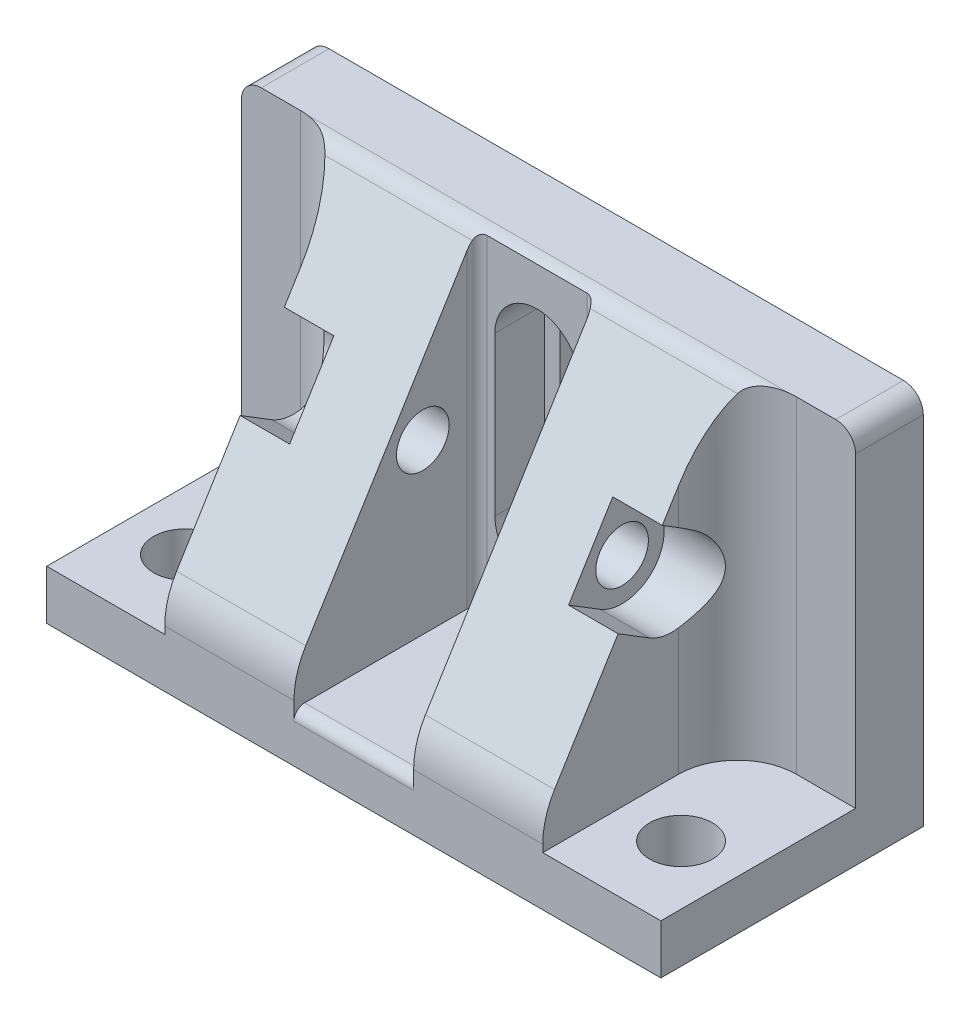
ISO-10303-21;
HEADER;
FILE_DESCRIPTION(('STEP AP214'),'2;1');
FILE_NAME('part.step','',(''),(''),'','','');
FILE_SCHEMA(('AUTOMOTIVE_DESIGN { 1 0 10303 214 1 1 1 1 }'));
ENDSEC;
DATA;
#1=APPLICATION_CONTEXT('core data for automotive mechanical design processes');
#2=APPLICATION_PROTOCOL_DEFINITION('international standard','automotive_design',2000,#1);
#3=PRODUCT_CONTEXT('',#1,'mechanical');
#4=PRODUCT('Part','Part','',(#3));
#5=PRODUCT_RELATED_PRODUCT_CATEGORY('part','',(#4));
#6=PRODUCT_DEFINITION_FORMATION('','',#4);
#7=PRODUCT_DEFINITION_CONTEXT('part definition',#1,'design');
#8=PRODUCT_DEFINITION('design','',#6,#7);
#9=PRODUCT_DEFINITION_SHAPE('','',#8);
#10=(LENGTH_UNIT() NAMED_UNIT(*) SI_UNIT(.MILLI.,.METRE.));
#11=(NAMED_UNIT(*) PLANE_ANGLE_UNIT() SI_UNIT($,.RADIAN.));
#12=(NAMED_UNIT(*) SI_UNIT($,.STERADIAN.) SOLID_ANGLE_UNIT());
#13=UNCERTAINTY_MEASURE_WITH_UNIT(LENGTH_MEASURE(1.E-05),#10,'distance_accuracy_value','');
#14=(GEOMETRIC_REPRESENTATION_CONTEXT(3) GLOBAL_UNCERTAINTY_ASSIGNED_CONTEXT((#13)) GLOBAL_UNIT_ASSIGNED_CONTEXT((#10,
#11,#12)) REPRESENTATION_CONTEXT('',''));
#15=CARTESIAN_POINT('',(0.,0.,0.));
#16=DIRECTION('',(0.,0.,1.));
#17=DIRECTION('',(1.,0.,0.));
#18=AXIS2_PLACEMENT_3D('',#15,#16,#17);
#19=CARTESIAN_POINT('',(-34.7091,7.9375,-21.7424));
#20=DIRECTION('',(0.,-1.,0.));
#21=DIRECTION('',(0.,0.,-1.));
#22=AXIS2_PLACEMENT_3D('',#19,#20,#21);
#23=PLANE('',#22);
#24=DIRECTION('',(-1.,0.,0.));
#25=VECTOR('',#24,1.);
#26=CARTESIAN_POINT('',(-39.751,7.9375,-31.2039));
#27=LINE('',#26,#25);
#28=CARTESIAN_POINT('',(-39.751,7.9375,-31.2039));
#29=VERTEX_POINT('',#28);
#30=CARTESIAN_POINT('',(-49.2125,7.9375,-31.2039));
#31=VERTEX_POINT('',#30);
#32=EDGE_CURVE('E764',#29,#31,#27,.T.);
#33=ORIENTED_EDGE('',*,*,#32,.T.);
#34=DIRECTION('',(0.,0.,1.));
#35=VECTOR('',#34,1.);
#36=CARTESIAN_POINT('',(-49.2125,7.9375,-21.7424));
#37=LINE('',#36,#35);
#38=CARTESIAN_POINT('',(-49.2125,7.9375,0.));
#39=VERTEX_POINT('',#38);
#40=EDGE_CURVE('E706',#31,#39,#37,.T.);
#41=ORIENTED_EDGE('',*,*,#40,.T.);
#42=DIRECTION('',(1.,0.,0.));
#43=VECTOR('',#42,1.);
#44=CARTESIAN_POINT('',(49.2125,7.9375,0.));
#45=LINE('',#44,#43);
#46=CARTESIAN_POINT('',(-30.2895,7.9375,0.));
#47=VERTEX_POINT('',#46);
#48=EDGE_CURVE('E721',#39,#47,#45,.T.);
#49=ORIENTED_EDGE('',*,*,#48,.T.);
#50=DIRECTION('',(0.,0.,-1.));
#51=VECTOR('',#50,1.);
#52=CARTESIAN_POINT('',(-30.2895,7.9375,-21.7424));
#53=LINE('',#52,#51);
#54=CARTESIAN_POINT('',(-30.2895,7.9375,-21.7424));
#55=VERTEX_POINT('',#54);
#56=EDGE_CURVE('E701',#47,#55,#53,.T.);
#57=ORIENTED_EDGE('',*,*,#56,.T.);
#58=CARTESIAN_POINT('',(-39.751,7.9375,-21.7424));
#59=DIRECTION('',(0.,1.,0.));
#60=DIRECTION('',(0.,0.,1.));
#61=AXIS2_PLACEMENT_3D('',#58,#59,#60);
#62=CIRCLE('',#61,9.46149999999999);
#63=EDGE_CURVE('E712',#55,#29,#62,.T.);
#64=ORIENTED_EDGE('',*,*,#63,.T.);
#65=EDGE_LOOP('',(#33,#41,#49,#57,#64));
#66=FACE_BOUND('',#65,.T.);
#67=CARTESIAN_POINT('',(-39.751,7.9375,-12.7));
#68=DIRECTION('',(0.,1.,0.));
#69=DIRECTION('',(0.,0.,1.));
#70=AXIS2_PLACEMENT_3D('',#67,#68,#69);
#71=CIRCLE('',#70,5.0419);
#72=CARTESIAN_POINT('',(-39.751,7.9375,-7.6581));
#73=VERTEX_POINT('',#72);
#74=EDGE_CURVE('E1198',#73,#73,#71,.T.);
#75=ORIENTED_EDGE('',*,*,#74,.F.);
#76=EDGE_LOOP('',(#75));
#77=FACE_BOUND('',#76,.T.);
#78=ADVANCED_FACE('F38',(#66,#77),#23,.F.);
#79=CARTESIAN_POINT('',(44.7929,7.9375,-21.7424));
#80=DIRECTION('',(0.,-1.,0.));
#81=DIRECTION('',(0.,0.,-1.));
#82=AXIS2_PLACEMENT_3D('',#79,#80,#81);
#83=PLANE('',#82);
#84=DIRECTION('',(-1.,0.,0.));
#85=VECTOR('',#84,1.);
#86=CARTESIAN_POINT('',(39.751,7.9375,-31.2039));
#87=LINE('',#86,#85);
#88=CARTESIAN_POINT('',(49.2125,7.9375,-31.2039));
#89=VERTEX_POINT('',#88);
#90=CARTESIAN_POINT('',(39.751,7.9375,-31.2039));
#91=VERTEX_POINT('',#90);
#92=EDGE_CURVE('E777',#89,#91,#87,.T.);
#93=ORIENTED_EDGE('',*,*,#92,.T.);
#94=CARTESIAN_POINT('',(39.751,7.9375,-21.7424));
#95=DIRECTION('',(0.,1.,0.));
#96=DIRECTION('',(0.,0.,-1.));
#97=AXIS2_PLACEMENT_3D('',#94,#95,#96);
#98=CIRCLE('',#97,9.46149999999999);
#99=CARTESIAN_POINT('',(30.2895,7.9375,-21.7424));
#100=VERTEX_POINT('',#99);
#101=EDGE_CURVE('E725',#91,#100,#98,.T.);
#102=ORIENTED_EDGE('',*,*,#101,.T.);
#103=DIRECTION('',(0.,0.,1.));
#104=VECTOR('',#103,1.);
#105=CARTESIAN_POINT('',(30.2895,7.9375,-21.7424));
#106=LINE('',#105,#104);
#107=CARTESIAN_POINT('',(30.2895,7.9375,0.));
#108=VERTEX_POINT('',#107);
#109=EDGE_CURVE('E728',#100,#108,#106,.T.);
#110=ORIENTED_EDGE('',*,*,#109,.T.);
#111=DIRECTION('',(-1.,0.,0.));
#112=VECTOR('',#111,1.);
#113=CARTESIAN_POINT('',(49.2125,7.9375,0.));
#114=LINE('',#113,#112);
#115=CARTESIAN_POINT('',(49.2125,7.9375,0.));
#116=VERTEX_POINT('',#115);
#117=EDGE_CURVE('E738',#116,#108,#114,.T.);
#118=ORIENTED_EDGE('',*,*,#117,.F.);
#119=DIRECTION('',(0.,0.,-1.));
#120=VECTOR('',#119,1.);
#121=CARTESIAN_POINT('',(49.2125,7.9375,-21.7424));
#122=LINE('',#121,#120);
#123=EDGE_CURVE('E724',#116,#89,#122,.T.);
#124=ORIENTED_EDGE('',*,*,#123,.T.);
#125=EDGE_LOOP('',(#93,#102,#110,#118,#124));
#126=FACE_BOUND('',#125,.T.);
#127=CARTESIAN_POINT('',(39.751,7.9375,-12.7));
#128=DIRECTION('',(0.,1.,0.));
#129=DIRECTION('',(0.,0.,1.));
#130=AXIS2_PLACEMENT_3D('',#127,#128,#129);
#131=CIRCLE('',#130,5.0419);
#132=CARTESIAN_POINT('',(39.751,7.9375,-7.65810000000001));
#133=VERTEX_POINT('',#132);
#134=EDGE_CURVE('E1200',#133,#133,#131,.T.);
#135=ORIENTED_EDGE('',*,*,#134,.F.);
#136=EDGE_LOOP('',(#135));
#137=FACE_BOUND('',#136,.T.);
#138=ADVANCED_FACE('F458',(#126,#137),#83,.F.);
#139=CARTESIAN_POINT('',(30.2895,34.925,-20.6502));
#140=DIRECTION('',(1.,0.,0.));
#141=DIRECTION('',(0.,0.,-1.));
#142=AXIS2_PLACEMENT_3D('',#139,#140,#141);
#143=CYLINDRICAL_SURFACE('',#142,6.74751);
#144=CARTESIAN_POINT('',(30.2895,41.5835276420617,-21.7424));
#145=CARTESIAN_POINT('',(30.2894628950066,41.5555131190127,-21.9134096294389));
#146=CARTESIAN_POINT('',(30.2941346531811,41.5208491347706,-22.0832853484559));
#147=CARTESIAN_POINT('',(30.3122565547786,41.4387481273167,-22.4193052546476));
#148=CARTESIAN_POINT('',(30.3256996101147,41.3913214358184,-22.5854523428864));
#149=CARTESIAN_POINT('',(30.3606107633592,41.2845288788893,-22.9117475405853));
#150=CARTESIAN_POINT('',(30.3820251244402,41.2252441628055,-23.0719280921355));
#151=CARTESIAN_POINT('',(30.4320626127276,41.0951748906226,-23.3863991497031));
#152=CARTESIAN_POINT('',(30.4606869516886,41.0243884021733,-23.5406886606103));
#153=CARTESIAN_POINT('',(30.5241192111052,40.8722478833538,-23.8419904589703));
#154=CARTESIAN_POINT('',(30.5589070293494,40.7909284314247,-23.9890244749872));
#155=CARTESIAN_POINT('',(30.6337401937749,40.6182222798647,-24.2756845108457));
#156=CARTESIAN_POINT('',(30.6737875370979,40.5268317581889,-24.4153076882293));
#157=CARTESIAN_POINT('',(30.8003735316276,40.2383332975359,-24.822498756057));
#158=CARTESIAN_POINT('',(30.8933072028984,40.0270107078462,-25.0781678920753));
#159=CARTESIAN_POINT('',(31.0973318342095,39.5482477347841,-25.5783015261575));
#160=CARTESIAN_POINT('',(31.2093088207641,39.2772987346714,-25.8190429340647));
#161=CARTESIAN_POINT('',(31.3756539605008,38.8444014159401,-26.1456464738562));
#162=CARTESIAN_POINT('',(31.430879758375,38.695548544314,-26.2488378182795));
#163=CARTESIAN_POINT('',(31.5391750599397,38.3893882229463,-26.4432808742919));
#164=CARTESIAN_POINT('',(31.5922441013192,38.2320789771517,-26.5345300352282));
#165=CARTESIAN_POINT('',(31.6992977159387,37.8943833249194,-26.7124963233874));
#166=CARTESIAN_POINT('',(31.7528970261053,37.7132193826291,-26.7979754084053));
#167=CARTESIAN_POINT('',(31.8530199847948,37.3424116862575,-26.9530057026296));
#168=CARTESIAN_POINT('',(31.8995476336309,37.1527728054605,-27.0225659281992));
#169=CARTESIAN_POINT('',(31.9830946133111,36.7664663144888,-27.1447240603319));
#170=CARTESIAN_POINT('',(32.0201324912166,36.5698132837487,-27.1973551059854));
#171=CARTESIAN_POINT('',(32.0826124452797,36.1707982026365,-27.2848478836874));
#172=CARTESIAN_POINT('',(32.1080581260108,35.9684379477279,-27.3197151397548));
#173=CARTESIAN_POINT('',(32.1429402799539,35.5898470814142,-27.3671786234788));
#174=CARTESIAN_POINT('',(32.1541655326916,35.4140915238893,-27.3822745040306));
#175=CARTESIAN_POINT('',(32.1663366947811,35.0615846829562,-27.3986334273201));
#176=CARTESIAN_POINT('',(32.1672836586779,34.8848335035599,-27.3998978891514));
#177=CARTESIAN_POINT('',(32.1588461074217,34.5320283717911,-27.3885692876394));
#178=CARTESIAN_POINT('',(32.1494613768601,34.3559744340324,-27.3759759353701));
#179=CARTESIAN_POINT('',(32.1208600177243,34.0061949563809,-27.3371763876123));
#180=CARTESIAN_POINT('',(32.1016435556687,33.8324693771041,-27.3109704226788));
#181=CARTESIAN_POINT('',(32.057381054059,33.5108400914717,-27.2496169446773));
#182=CARTESIAN_POINT('',(32.0333995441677,33.3624835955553,-27.2160484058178));
#183=CARTESIAN_POINT('',(31.9795374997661,33.0693524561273,-27.1393016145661));
#184=CARTESIAN_POINT('',(31.9496551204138,32.9245789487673,-27.0961203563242));
#185=CARTESIAN_POINT('',(31.852561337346,32.4966515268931,-26.952773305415));
#186=CARTESIAN_POINT('',(31.7778770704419,32.2197139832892,-26.8387699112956));
#187=CARTESIAN_POINT('',(31.6049168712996,31.6478236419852,-26.5582244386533));
#188=CARTESIAN_POINT('',(31.5047924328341,31.3560180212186,-26.3864811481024));
#189=CARTESIAN_POINT('',(31.2998168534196,30.8019009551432,-26.0020861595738));
#190=CARTESIAN_POINT('',(31.19495990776,30.5396271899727,-25.7893831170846));
#191=CARTESIAN_POINT('',(31.0334967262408,30.1513452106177,-25.4230105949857));
#192=CARTESIAN_POINT('',(30.9750297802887,30.0141762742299,-25.2817904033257));
#193=CARTESIAN_POINT('',(30.8618139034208,29.7519755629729,-24.9869746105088));
#194=CARTESIAN_POINT('',(30.8070659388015,29.6269469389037,-24.8333758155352));
#195=CARTESIAN_POINT('',(30.7032689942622,29.3903317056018,-24.5148632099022));
#196=CARTESIAN_POINT('',(30.6542085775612,29.2787181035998,-24.3499732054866));
#197=CARTESIAN_POINT('',(30.5634572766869,29.0697967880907,-24.0095630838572));
#198=CARTESIAN_POINT('',(30.5217612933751,28.9724791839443,-23.8340504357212));
#199=CARTESIAN_POINT('',(30.4539721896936,28.8091101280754,-23.505413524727));
#200=CARTESIAN_POINT('',(30.4264237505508,28.7405730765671,-23.3538207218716));
#201=CARTESIAN_POINT('',(30.378301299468,28.6145836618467,-23.0450551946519));
#202=CARTESIAN_POINT('',(30.3577252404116,28.5571280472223,-22.8878841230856));
#203=CARTESIAN_POINT('',(30.3242098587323,28.4535690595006,-22.5679781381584));
#204=CARTESIAN_POINT('',(30.3113173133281,28.4075361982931,-22.4052153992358));
#205=CARTESIAN_POINT('',(30.2939416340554,28.3276958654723,-22.0761321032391));
#206=CARTESIAN_POINT('',(30.2894659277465,28.2938992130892,-21.9098085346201));
#207=CARTESIAN_POINT('',(30.2895,28.2664723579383,-21.7424));
#208=B_SPLINE_CURVE_WITH_KNOTS('',3,(#144,#145,#146,#147,#148,#149,#150,#151,#152,#153,#154,
#155,#156,#157,#158,#159,#160,#161,#162,#163,#164,#165,#166,#167,#168,#169,#170,#171,#172,#173,
#174,#175,#176,#177,#178,#179,#180,#181,#182,#183,#184,#185,#186,#187,#188,#189,#190,#191,#192,
#193,#194,#195,#196,#197,#198,#199,#200,#201,#202,#203,#204,#205,#206,#207),.UNSPECIFIED.,.F.,
.F.,(4,2,2,2,2,2,2,2,2,2,2,2,2,2,2,2,2,2,2,2,2,2,2,2,2,2,2,2,2,2,2,4),(0.,0.519609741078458,
1.03880010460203,1.5545520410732,2.07039071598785,2.58457695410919,3.09895900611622,
4.12847102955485,5.26169058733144,5.82929168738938,6.3970138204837,7.01825228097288,
7.63913799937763,8.25880082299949,8.87827083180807,9.40774240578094,9.93715965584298,
10.4665879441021,10.9960072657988,11.4574885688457,11.9191143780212,12.8418257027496,
13.8973894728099,14.9542851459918,15.5697457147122,16.185365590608,16.7997252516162,
17.4136578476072,17.9189928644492,18.4241793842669,18.9324108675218,19.441090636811),.UNSPECIFIED.);
#209=CARTESIAN_POINT('',(30.6119250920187,40.6686260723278,-24.1913369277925));
#210=VERTEX_POINT('',#209);
#211=CARTESIAN_POINT('',(30.2895,28.2664723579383,-21.7424));
#212=VERTEX_POINT('',#211);
#213=EDGE_CURVE('E428',#210,#212,#208,.T.);
#214=ORIENTED_EDGE('',*,*,#213,.F.);
#215=DIRECTION('',(1.,0.,0.));
#216=VECTOR('',#215,1.);
#217=CARTESIAN_POINT('',(30.2895,40.6686260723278,-24.1913369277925));
#218=LINE('',#217,#216);
#219=CARTESIAN_POINT('',(22.352,40.6686260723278,-24.1913369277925));
#220=VERTEX_POINT('',#219);
#221=EDGE_CURVE('E889',#210,#220,#218,.F.);
#222=ORIENTED_EDGE('',*,*,#221,.T.);
#223=CARTESIAN_POINT('',(22.352,34.925,-20.6502));
#224=DIRECTION('',(1.,0.,0.));
#225=DIRECTION('',(0.,0.,-1.));
#226=AXIS2_PLACEMENT_3D('',#223,#224,#225);
#227=CIRCLE('',#226,6.74751);
#228=CARTESIAN_POINT('',(22.352,29.1813739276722,-17.1090630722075));
#229=VERTEX_POINT('',#228);
#230=EDGE_CURVE('E861',#229,#220,#227,.T.);
#231=ORIENTED_EDGE('',*,*,#230,.F.);
#232=DIRECTION('',(1.,0.,0.));
#233=VECTOR('',#232,1.);
#234=CARTESIAN_POINT('',(30.2895,29.1813739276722,-17.1090630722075));
#235=LINE('',#234,#233);
#236=CARTESIAN_POINT('',(30.2895,29.1813739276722,-17.1090630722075));
#237=VERTEX_POINT('',#236);
#238=EDGE_CURVE('E860',#237,#229,#235,.F.);
#239=ORIENTED_EDGE('',*,*,#238,.F.);
#240=CARTESIAN_POINT('',(30.2895,34.925,-20.6502));
#241=DIRECTION('',(1.,0.,0.));
#242=DIRECTION('',(0.,0.,-1.));
#243=AXIS2_PLACEMENT_3D('',#240,#241,#242);
#244=CIRCLE('',#243,6.74751);
#245=EDGE_CURVE('E852',#237,#212,#244,.T.);
#246=ORIENTED_EDGE('',*,*,#245,.T.);
#247=EDGE_LOOP('',(#214,#222,#231,#239,#246));
#248=FACE_BOUND('',#247,.T.);
#249=ADVANCED_FACE('F454',(#248),#143,.F.);
#250=CARTESIAN_POINT('',(-39.751,60.325,-21.7424));
#251=DIRECTION('',(0.,-1.,0.));
#252=DIRECTION('',(0.,0.,-1.));
#253=AXIS2_PLACEMENT_3D('',#250,#251,#252);
#254=CYLINDRICAL_SURFACE('',#253,9.46149999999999);
#255=CARTESIAN_POINT('',(-30.2895,28.2664723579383,-21.7424));
#256=CARTESIAN_POINT('',(-30.2894628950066,28.2944868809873,-21.9134096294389));
#257=CARTESIAN_POINT('',(-30.2941346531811,28.3291508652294,-22.0832853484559));
#258=CARTESIAN_POINT('',(-30.3122565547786,28.4112518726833,-22.4193052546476));
#259=CARTESIAN_POINT('',(-30.3256996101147,28.4586785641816,-22.5854523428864));
#260=CARTESIAN_POINT('',(-30.3606107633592,28.5654711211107,-22.9117475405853));
#261=CARTESIAN_POINT('',(-30.3820251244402,28.6247558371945,-23.0719280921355));
#262=CARTESIAN_POINT('',(-30.4320626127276,28.7548251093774,-23.3863991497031));
#263=CARTESIAN_POINT('',(-30.4606869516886,28.8256115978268,-23.5406886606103));
#264=CARTESIAN_POINT('',(-30.5241192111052,28.9777521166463,-23.8419904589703));
#265=CARTESIAN_POINT('',(-30.5589070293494,29.0590715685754,-23.9890244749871));
#266=CARTESIAN_POINT('',(-30.6337401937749,29.2317777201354,-24.2756845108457));
#267=CARTESIAN_POINT('',(-30.6737875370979,29.3231682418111,-24.4153076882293));
#268=CARTESIAN_POINT('',(-30.8003735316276,29.6116667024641,-24.822498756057));
#269=CARTESIAN_POINT('',(-30.8933072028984,29.8229892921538,-25.0781678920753));
#270=CARTESIAN_POINT('',(-31.0973318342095,30.3017522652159,-25.5783015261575));
#271=CARTESIAN_POINT('',(-31.2093088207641,30.5727012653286,-25.8190429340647));
#272=CARTESIAN_POINT('',(-31.3756539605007,31.0055985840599,-26.1456464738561));
#273=CARTESIAN_POINT('',(-31.430879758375,31.154451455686,-26.2488378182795));
#274=CARTESIAN_POINT('',(-31.5391750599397,31.4606117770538,-26.4432808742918));
#275=CARTESIAN_POINT('',(-31.5922441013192,31.6179210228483,-26.5345300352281));
#276=CARTESIAN_POINT('',(-31.6992977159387,31.9556166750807,-26.7124963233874));
#277=CARTESIAN_POINT('',(-31.7528970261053,32.136780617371,-26.7979754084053));
#278=CARTESIAN_POINT('',(-31.8530199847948,32.5075883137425,-26.9530057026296));
#279=CARTESIAN_POINT('',(-31.8995476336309,32.6972271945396,-27.0225659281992));
#280=CARTESIAN_POINT('',(-31.9830946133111,33.0835336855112,-27.1447240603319));
#281=CARTESIAN_POINT('',(-32.0201324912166,33.2801867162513,-27.1973551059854));
#282=CARTESIAN_POINT('',(-32.0826124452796,33.6792017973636,-27.2848478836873));
#283=CARTESIAN_POINT('',(-32.1080581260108,33.8815620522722,-27.3197151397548));
#284=CARTESIAN_POINT('',(-32.1429402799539,34.2601529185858,-27.3671786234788));
#285=CARTESIAN_POINT('',(-32.1541655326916,34.4359084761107,-27.3822745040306));
#286=CARTESIAN_POINT('',(-32.1663366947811,34.7884153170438,-27.3986334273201));
#287=CARTESIAN_POINT('',(-32.1672836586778,34.9651664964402,-27.3998978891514));
#288=CARTESIAN_POINT('',(-32.1588461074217,35.317971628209,-27.3885692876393));
#289=CARTESIAN_POINT('',(-32.1494613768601,35.4940255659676,-27.3759759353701));
#290=CARTESIAN_POINT('',(-32.1208600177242,35.8438050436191,-27.3371763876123));
#291=CARTESIAN_POINT('',(-32.1016435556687,36.0175306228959,-27.3109704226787));
#292=CARTESIAN_POINT('',(-32.0573810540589,36.3391599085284,-27.2496169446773));
#293=CARTESIAN_POINT('',(-32.0333995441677,36.4875164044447,-27.2160484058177));
#294=CARTESIAN_POINT('',(-31.9795374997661,36.7806475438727,-27.1393016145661));
#295=CARTESIAN_POINT('',(-31.9496551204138,36.9254210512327,-27.0961203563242));
#296=CARTESIAN_POINT('',(-31.852561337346,37.3533484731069,-26.9527733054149));
#297=CARTESIAN_POINT('',(-31.7778770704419,37.6302860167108,-26.8387699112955));
#298=CARTESIAN_POINT('',(-31.6049168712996,38.2021763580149,-26.5582244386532));
#299=CARTESIAN_POINT('',(-31.5047924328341,38.4939819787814,-26.3864811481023));
#300=CARTESIAN_POINT('',(-31.2998168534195,39.0480990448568,-26.0020861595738));
#301=CARTESIAN_POINT('',(-31.19495990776,39.3103728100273,-25.7893831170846));
#302=CARTESIAN_POINT('',(-31.0334967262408,39.6986547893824,-25.4230105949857));
#303=CARTESIAN_POINT('',(-30.9750297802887,39.8358237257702,-25.2817904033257));
#304=CARTESIAN_POINT('',(-30.8618139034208,40.0980244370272,-24.9869746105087));
#305=CARTESIAN_POINT('',(-30.8070659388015,40.2230530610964,-24.8333758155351));
#306=CARTESIAN_POINT('',(-30.7032689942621,40.4596682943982,-24.5148632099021));
#307=CARTESIAN_POINT('',(-30.6542085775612,40.5712818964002,-24.3499732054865));
#308=CARTESIAN_POINT('',(-30.5634572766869,40.7802032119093,-24.0095630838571));
#309=CARTESIAN_POINT('',(-30.5217612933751,40.8775208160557,-23.8340504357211));
#310=CARTESIAN_POINT('',(-30.4539721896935,41.0408898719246,-23.5054135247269));
#311=CARTESIAN_POINT('',(-30.4264237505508,41.1094269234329,-23.3538207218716));
#312=CARTESIAN_POINT('',(-30.378301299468,41.2354163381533,-23.0450551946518));
#313=CARTESIAN_POINT('',(-30.3577252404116,41.2928719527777,-22.8878841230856));
#314=CARTESIAN_POINT('',(-30.3242098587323,41.3964309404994,-22.5679781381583));
#315=CARTESIAN_POINT('',(-30.3113173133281,41.4424638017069,-22.4052153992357));
#316=CARTESIAN_POINT('',(-30.2939416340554,41.5223041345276,-22.0761321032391));
#317=CARTESIAN_POINT('',(-30.2894659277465,41.5561007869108,-21.9098085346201));
#318=CARTESIAN_POINT('',(-30.2895,41.5835276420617,-21.7424));
#319=B_SPLINE_CURVE_WITH_KNOTS('',3,(#255,#256,#257,#258,#259,#260,#261,#262,#263,#264,#265,
#266,#267,#268,#269,#270,#271,#272,#273,#274,#275,#276,#277,#278,#279,#280,#281,#282,#283,#284,
#285,#286,#287,#288,#289,#290,#291,#292,#293,#294,#295,#296,#297,#298,#299,#300,#301,#302,#303,
#304,#305,#306,#307,#308,#309,#310,#311,#312,#313,#314,#315,#316,#317,#318),.UNSPECIFIED.,.F.,
.F.,(4,2,2,2,2,2,2,2,2,2,2,2,2,2,2,2,2,2,2,2,2,2,2,2,2,2,2,2,2,2,2,4),(0.,0.519609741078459,
1.03880010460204,1.55455204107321,2.07039071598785,2.58457695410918,3.09895900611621,
4.12847102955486,5.26169058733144,5.82929168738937,6.3970138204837,7.01825228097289,
7.63913799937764,8.2588008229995,8.87827083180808,9.40774240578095,9.93715965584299,
10.4665879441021,10.9960072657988,11.4574885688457,11.9191143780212,12.8418257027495,
13.8973894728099,14.9542851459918,15.5697457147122,16.185365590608,16.7997252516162,
17.4136578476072,17.9189928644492,18.4241793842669,18.9324108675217,19.4410906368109),.UNSPECIFIED.);
#320=CARTESIAN_POINT('',(-30.2895,28.2664723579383,-21.7424));
#321=VERTEX_POINT('',#320);
#322=CARTESIAN_POINT('',(-30.6119250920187,40.6686260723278,-24.1913369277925));
#323=VERTEX_POINT('',#322);
#324=EDGE_CURVE('E436',#321,#323,#319,.T.);
#325=ORIENTED_EDGE('',*,*,#324,.T.);
#326=CARTESIAN_POINT('',(-39.751,42.1784773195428,-21.7424));
#327=DIRECTION('',(0.,-0.851221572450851,0.524806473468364));
#328=DIRECTION('',(0.,-0.524806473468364,-0.851221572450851));
#329=AXIS2_PLACEMENT_3D('',#326,#327,#328);
#330=ELLIPSE('',#329,11.1152023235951,9.46149999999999);
#331=CARTESIAN_POINT('',(-30.2895,42.1784773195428,-21.7424));
#332=VERTEX_POINT('',#331);
#333=EDGE_CURVE('E419',#323,#332,#330,.T.);
#334=ORIENTED_EDGE('',*,*,#333,.T.);
#335=DIRECTION('',(0.,-1.,0.));
#336=VECTOR('',#335,1.);
#337=CARTESIAN_POINT('',(-30.2895,60.325,-21.7424));
#338=LINE('',#337,#336);
#339=CARTESIAN_POINT('',(-30.2895,47.9655709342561,-21.7424));
#340=VERTEX_POINT('',#339);
#341=EDGE_CURVE('E703',#340,#332,#338,.T.);
#342=ORIENTED_EDGE('',*,*,#341,.F.);
#343=CARTESIAN_POINT('',(-39.751,47.9655709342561,-21.7424));
#344=DIRECTION('',(0.,-0.524806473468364,-0.851221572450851));
#345=DIRECTION('',(0.,-0.851221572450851,0.524806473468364));
#346=AXIS2_PLACEMENT_3D('',#343,#344,#345);
#347=ELLIPSE('',#346,18.0285504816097,9.46149999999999);
#348=CARTESIAN_POINT('',(-33.0602302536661,58.816260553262,-28.4322118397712));
#349=VERTEX_POINT('',#348);
#350=EDGE_CURVE('E643',#340,#349,#347,.F.);
#351=ORIENTED_EDGE('',*,*,#350,.T.);
#352=CARTESIAN_POINT('',(-38.6099273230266,60.325,-31.1348403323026));
#353=CARTESIAN_POINT('',(-38.4805175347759,60.3249862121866,-31.1191201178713));
#354=CARTESIAN_POINT('',(-38.3514330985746,60.3248828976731,-31.1007222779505));
#355=CARTESIAN_POINT('',(-38.0941270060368,60.3241582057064,-31.0586086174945));
#356=CARTESIAN_POINT('',(-37.9659054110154,60.3235367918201,-31.0348924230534));
#357=CARTESIAN_POINT('',(-37.7102492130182,60.3214342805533,-30.982118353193));
#358=CARTESIAN_POINT('',(-37.5828172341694,60.3199511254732,-30.9530478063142));
#359=CARTESIAN_POINT('',(-37.3292983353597,60.3156780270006,-30.8896630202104));
#360=CARTESIAN_POINT('',(-37.2032113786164,60.3128881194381,-30.8553489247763));
#361=CARTESIAN_POINT('',(-36.8255523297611,60.3017595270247,-30.7441168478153));
#362=CARTESIAN_POINT('',(-36.5763355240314,60.2906629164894,-30.6592708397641));
#363=CARTESIAN_POINT('',(-36.0868168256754,60.2560041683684,-30.4695109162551));
#364=CARTESIAN_POINT('',(-35.8465030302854,60.2324593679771,-30.3646250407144));
#365=CARTESIAN_POINT('',(-35.4984331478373,60.1833459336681,-30.1953088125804));
#366=CARTESIAN_POINT('',(-35.3861922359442,60.16507456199,-30.1378887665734));
#367=CARTESIAN_POINT('',(-35.1648559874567,60.1231509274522,-30.0190554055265));
#368=CARTESIAN_POINT('',(-35.0557604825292,60.0994989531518,-29.9576423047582));
#369=CARTESIAN_POINT('',(-34.8412527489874,60.0458667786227,-29.8312724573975));
#370=CARTESIAN_POINT('',(-34.7358397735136,60.015887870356,-29.7663164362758));
#371=CARTESIAN_POINT('',(-34.5292843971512,59.9485731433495,-29.6334545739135));
#372=CARTESIAN_POINT('',(-34.428141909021,59.9112374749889,-29.5655487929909));
#373=CARTESIAN_POINT('',(-34.22922242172,59.8274599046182,-29.426469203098));
#374=CARTESIAN_POINT('',(-34.1315286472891,59.7808777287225,-29.3552599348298));
#375=CARTESIAN_POINT('',(-33.9421771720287,59.6778979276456,-29.2117819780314));
#376=CARTESIAN_POINT('',(-33.850521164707,59.6214975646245,-29.1395129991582));
#377=CARTESIAN_POINT('',(-33.6747737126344,59.4982293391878,-28.99583182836));
#378=CARTESIAN_POINT('',(-33.5906458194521,59.4314167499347,-28.9244171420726));
#379=CARTESIAN_POINT('',(-33.4306468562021,59.2864519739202,-28.7840207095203));
#380=CARTESIAN_POINT('',(-33.3547657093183,59.2083139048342,-28.7150360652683));
#381=CARTESIAN_POINT('',(-33.2432365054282,59.0767830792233,-28.6105923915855));
#382=CARTESIAN_POINT('',(-33.2043933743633,59.0273239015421,-28.5735495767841));
#383=CARTESIAN_POINT('',(-33.1298673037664,58.9246151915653,-28.5013413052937));
#384=CARTESIAN_POINT('',(-33.0941900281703,58.8713591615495,-28.4661792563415));
#385=CARTESIAN_POINT('',(-33.0602302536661,58.816260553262,-28.4322118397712));
#386=B_SPLINE_CURVE_WITH_KNOTS('',3,(#352,#353,#354,#355,#356,#357,#358,#359,#360,#361,#362,
#363,#364,#365,#366,#367,#368,#369,#370,#371,#372,#373,#374,#375,#376,#377,#378,#379,#380,#381,
#382,#383,#384,#385),.UNSPECIFIED.,.F.,.F.,(4,2,2,2,2,2,2,2,2,2,2,2,2,2,2,2,4),(0.,
0.391054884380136,0.782137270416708,1.17415735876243,1.56616669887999,2.35553832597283,
3.14381344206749,3.5258174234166,3.90780092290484,4.2897064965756,4.67160426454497,
5.05981235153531,5.448128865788,5.83445013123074,6.22029390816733,6.43908287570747,
6.65825569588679),.UNSPECIFIED.);
#387=CARTESIAN_POINT('',(-38.6099273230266,60.325,-31.1348403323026));
#388=VERTEX_POINT('',#387);
#389=EDGE_CURVE('E515',#388,#349,#386,.T.);
#390=ORIENTED_EDGE('',*,*,#389,.F.);
#391=CARTESIAN_POINT('',(-39.751,60.325,-21.7424));
#392=DIRECTION('',(0.,1.,0.));
#393=DIRECTION('',(0.,0.,1.));
#394=AXIS2_PLACEMENT_3D('',#391,#392,#393);
#395=CIRCLE('',#394,9.46149999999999);
#396=CARTESIAN_POINT('',(-39.751,60.325,-31.2039));
#397=VERTEX_POINT('',#396);
#398=EDGE_CURVE('E695',#388,#397,#395,.T.);
#399=ORIENTED_EDGE('',*,*,#398,.T.);
#400=DIRECTION('',(0.,1.,0.));
#401=VECTOR('',#400,1.);
#402=CARTESIAN_POINT('',(-39.751,-5.44308162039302,-31.2039));
#403=LINE('',#402,#401);
#404=EDGE_CURVE('E729',#29,#397,#403,.T.);
#405=ORIENTED_EDGE('',*,*,#404,.F.);
#406=ORIENTED_EDGE('',*,*,#63,.F.);
#407=EDGE_CURVE('E700',#321,#55,#338,.T.);
#408=ORIENTED_EDGE('',*,*,#407,.F.);
#409=EDGE_LOOP('',(#325,#334,#342,#351,#390,#399,#405,#406,#408));
#410=FACE_BOUND('',#409,.T.);
#411=ADVANCED_FACE('F457',(#410),#254,.F.);
#412=CARTESIAN_POINT('',(-30.2895,60.325,-21.7424));
#413=DIRECTION('',(-1.,0.,0.));
#414=DIRECTION('',(0.,0.,1.));
#415=AXIS2_PLACEMENT_3D('',#412,#413,#414);
#416=PLANE('',#415);
#417=ORIENTED_EDGE('',*,*,#341,.T.);
#418=DIRECTION('',(0.,0.524806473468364,0.851221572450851));
#419=VECTOR('',#418,1.);
#420=CARTESIAN_POINT('',(-30.2895,47.1764258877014,-13.6358657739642));
#421=LINE('',#420,#419);
#422=CARTESIAN_POINT('',(-30.2895,43.7723692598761,-19.1571513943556));
#423=VERTEX_POINT('',#422);
#424=EDGE_CURVE('E416',#332,#423,#421,.T.);
#425=ORIENTED_EDGE('',*,*,#424,.T.);
#426=DIRECTION('',(0.,0.851221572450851,-0.524806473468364));
#427=VECTOR('',#426,1.);
#428=CARTESIAN_POINT('',(-30.2895,12.7,0.));
#429=LINE('',#428,#427);
#430=EDGE_CURVE('E745',#423,#340,#429,.T.);
#431=ORIENTED_EDGE('',*,*,#430,.T.);
#432=EDGE_LOOP('',(#417,#425,#431));
#433=FACE_BOUND('',#432,.T.);
#434=ADVANCED_FACE('F506',(#433),#416,.T.);
#435=CARTESIAN_POINT('',(49.2125,12.7,0.));
#436=DIRECTION('',(0.,-0.524806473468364,-0.851221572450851));
#437=DIRECTION('',(0.,0.851221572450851,-0.524806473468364));
#438=AXIS2_PLACEMENT_3D('',#435,#436,#437);
#439=PLANE('',#438);
#440=DIRECTION('',(1.,0.,0.));
#441=VECTOR('',#440,1.);
#442=CARTESIAN_POINT('',(49.2125,32.2851171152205,-12.0748775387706));
#443=LINE('',#442,#441);
#444=CARTESIAN_POINT('',(-30.2895,32.2851171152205,-12.0748775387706));
#445=VERTEX_POINT('',#444);
#446=CARTESIAN_POINT('',(-22.352,32.2851171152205,-12.0748775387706));
#447=VERTEX_POINT('',#446);
#448=EDGE_CURVE('E425',#445,#447,#443,.T.);
#449=ORIENTED_EDGE('',*,*,#448,.F.);
#450=CARTESIAN_POINT('',(-30.2895,15.7646940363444,-1.8894860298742));
#451=VERTEX_POINT('',#450);
#452=EDGE_CURVE('E746',#451,#445,#429,.T.);
#453=ORIENTED_EDGE('',*,*,#452,.F.);
#454=DIRECTION('',(-1.,0.,0.));
#455=VECTOR('',#454,1.);
#456=CARTESIAN_POINT('',(49.2125,15.7646940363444,-1.8894860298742));
#457=LINE('',#456,#455);
#458=CARTESIAN_POINT('',(-9.5885,15.7646940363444,-1.8894860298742));
#459=VERTEX_POINT('',#458);
#460=EDGE_CURVE('E673',#451,#459,#457,.F.);
#461=ORIENTED_EDGE('',*,*,#460,.T.);
#462=DIRECTION('',(0.,0.851221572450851,-0.524806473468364));
#463=VECTOR('',#462,1.);
#464=CARTESIAN_POINT('',(-9.58849999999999,12.7,0.));
#465=LINE('',#464,#463);
#466=CARTESIAN_POINT('',(-9.5885,57.7501189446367,-27.7749));
#467=VERTEX_POINT('',#466);
#468=EDGE_CURVE('E830',#459,#467,#465,.T.);
#469=ORIENTED_EDGE('',*,*,#468,.T.);
#470=CARTESIAN_POINT('',(-8.001,57.7501189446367,-27.7749));
#471=DIRECTION('',(0.,-0.524806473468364,-0.851221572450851));
#472=DIRECTION('',(0.,-0.851221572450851,0.524806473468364));
#473=AXIS2_PLACEMENT_3D('',#470,#471,#472);
#474=ELLIPSE('',#473,3.0249245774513,1.5875);
#475=CARTESIAN_POINT('',(-9.44602505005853,58.8162605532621,-28.4322118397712));
#476=VERTEX_POINT('',#475);
#477=EDGE_CURVE('E555',#467,#476,#474,.T.);
#478=ORIENTED_EDGE('',*,*,#477,.T.);
#479=DIRECTION('',(-1.,0.,0.));
#480=VECTOR('',#479,1.);
#481=CARTESIAN_POINT('',(49.2125,58.8162605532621,-28.4322118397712));
#482=LINE('',#481,#480);
#483=EDGE_CURVE('E662',#476,#349,#482,.T.);
#484=ORIENTED_EDGE('',*,*,#483,.T.);
#485=ORIENTED_EDGE('',*,*,#350,.F.);
#486=ORIENTED_EDGE('',*,*,#430,.F.);
#487=DIRECTION('',(-1.,0.,0.));
#488=VECTOR('',#487,1.);
#489=CARTESIAN_POINT('',(49.2125,43.7723692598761,-19.1571513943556));
#490=LINE('',#489,#488);
#491=CARTESIAN_POINT('',(-22.352,43.7723692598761,-19.1571513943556));
#492=VERTEX_POINT('',#491);
#493=EDGE_CURVE('E414',#492,#423,#490,.T.);
#494=ORIENTED_EDGE('',*,*,#493,.F.);
#495=DIRECTION('',(0.,-0.851221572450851,0.524806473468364));
#496=VECTOR('',#495,1.);
#497=CARTESIAN_POINT('',(-22.352,12.7,0.));
#498=LINE('',#497,#496);
#499=EDGE_CURVE('E874',#492,#447,#498,.T.);
#500=ORIENTED_EDGE('',*,*,#499,.T.);
#501=EDGE_LOOP('',(#449,#453,#461,#469,#478,#484,#485,#486,#494,#500));
#502=FACE_BOUND('',#501,.T.);
#503=ADVANCED_FACE('F508',(#502),#439,.F.);
#504=ORIENTED_EDGE('',*,*,#452,.T.);
#505=DIRECTION('',(0.,-0.524806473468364,-0.851221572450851));
#506=VECTOR('',#505,1.);
#507=CARTESIAN_POINT('',(-30.2895,35.6891737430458,-6.55359191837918));
#508=LINE('',#507,#506);
#509=CARTESIAN_POINT('',(-30.2895,29.1813739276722,-17.1090630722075));
#510=VERTEX_POINT('',#509);
#511=EDGE_CURVE('E422',#445,#510,#508,.T.);
#512=ORIENTED_EDGE('',*,*,#511,.T.);
#513=CARTESIAN_POINT('',(-30.2895,34.925,-20.6502));
#514=DIRECTION('',(-1.,0.,0.));
#515=DIRECTION('',(0.,0.,1.));
#516=AXIS2_PLACEMENT_3D('',#513,#514,#515);
#517=CIRCLE('',#516,6.74751);
#518=EDGE_CURVE('E871',#321,#510,#517,.T.);
#519=ORIENTED_EDGE('',*,*,#518,.F.);
#520=ORIENTED_EDGE('',*,*,#407,.T.);
#521=ORIENTED_EDGE('',*,*,#56,.F.);
#522=DIRECTION('',(0.,-1.,0.));
#523=VECTOR('',#522,1.);
#524=CARTESIAN_POINT('',(-30.2895,60.325,0.));
#525=LINE('',#524,#523);
#526=CARTESIAN_POINT('',(-30.2895,9.09965182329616,0.));
#527=VERTEX_POINT('',#526);
#528=EDGE_CURVE('E718',#527,#47,#525,.T.);
#529=ORIENTED_EDGE('',*,*,#528,.F.);
#530=CARTESIAN_POINT('',(-30.2895,9.09965182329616,-12.7));
#531=DIRECTION('',(-1.,0.,0.));
#532=DIRECTION('',(0.,0.,1.));
#533=AXIS2_PLACEMENT_3D('',#530,#531,#532);
#534=CIRCLE('',#533,12.7);
#535=EDGE_CURVE('E678',#451,#527,#534,.F.);
#536=ORIENTED_EDGE('',*,*,#535,.F.);
#537=EDGE_LOOP('',(#504,#512,#519,#520,#521,#529,#536));
#538=FACE_BOUND('',#537,.T.);
#539=ADVANCED_FACE('F472',(#538),#416,.T.);
#540=CARTESIAN_POINT('',(-30.2895,34.925,-20.6502));
#541=DIRECTION('',(-1.,0.,0.));
#542=DIRECTION('',(0.,0.,1.));
#543=AXIS2_PLACEMENT_3D('',#540,#541,#542);
#544=CYLINDRICAL_SURFACE('',#543,6.74751);
#545=ORIENTED_EDGE('',*,*,#518,.T.);
#546=DIRECTION('',(-1.,0.,0.));
#547=VECTOR('',#546,1.);
#548=CARTESIAN_POINT('',(-30.2895,29.1813739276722,-17.1090630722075));
#549=LINE('',#548,#547);
#550=CARTESIAN_POINT('',(-22.352,29.1813739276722,-17.1090630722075));
#551=VERTEX_POINT('',#550);
#552=EDGE_CURVE('E914',#510,#551,#549,.F.);
#553=ORIENTED_EDGE('',*,*,#552,.T.);
#554=CARTESIAN_POINT('',(-22.352,34.925,-20.6502));
#555=DIRECTION('',(-1.,0.,0.));
#556=DIRECTION('',(0.,0.,1.));
#557=AXIS2_PLACEMENT_3D('',#554,#555,#556);
#558=CIRCLE('',#557,6.74751);
#559=CARTESIAN_POINT('',(-22.352,40.6686260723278,-24.1913369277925));
#560=VERTEX_POINT('',#559);
#561=EDGE_CURVE('E875',#560,#551,#558,.T.);
#562=ORIENTED_EDGE('',*,*,#561,.F.);
#563=DIRECTION('',(-1.,0.,0.));
#564=VECTOR('',#563,1.);
#565=CARTESIAN_POINT('',(-30.2895,40.6686260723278,-24.1913369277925));
#566=LINE('',#565,#564);
#567=EDGE_CURVE('E911',#323,#560,#566,.F.);
#568=ORIENTED_EDGE('',*,*,#567,.F.);
#569=ORIENTED_EDGE('',*,*,#324,.F.);
#570=EDGE_LOOP('',(#545,#553,#562,#568,#569));
#571=FACE_BOUND('',#570,.T.);
#572=ADVANCED_FACE('F469',(#571),#544,.F.);
#573=CARTESIAN_POINT('',(39.751,60.325,-21.7424));
#574=DIRECTION('',(0.,-1.,0.));
#575=DIRECTION('',(0.,0.,-1.));
#576=AXIS2_PLACEMENT_3D('',#573,#574,#575);
#577=CYLINDRICAL_SURFACE('',#576,9.46149999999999);
#578=CARTESIAN_POINT('',(39.751,42.1784773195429,-21.7424));
#579=DIRECTION('',(0.,0.851221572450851,-0.524806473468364));
#580=DIRECTION('',(0.,-0.524806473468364,-0.851221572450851));
#581=AXIS2_PLACEMENT_3D('',#578,#579,#580);
#582=ELLIPSE('',#581,11.1152023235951,9.46149999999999);
#583=CARTESIAN_POINT('',(30.2895,42.1784773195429,-21.7424));
#584=VERTEX_POINT('',#583);
#585=EDGE_CURVE('E407',#210,#584,#582,.T.);
#586=ORIENTED_EDGE('',*,*,#585,.F.);
#587=ORIENTED_EDGE('',*,*,#213,.T.);
#588=DIRECTION('',(0.,-1.,0.));
#589=VECTOR('',#588,1.);
#590=CARTESIAN_POINT('',(30.2895,60.325,-21.7424));
#591=LINE('',#590,#589);
#592=EDGE_CURVE('E734',#212,#100,#591,.T.);
#593=ORIENTED_EDGE('',*,*,#592,.T.);
#594=ORIENTED_EDGE('',*,*,#101,.F.);
#595=DIRECTION('',(0.,1.,0.));
#596=VECTOR('',#595,1.);
#597=CARTESIAN_POINT('',(39.751,-5.44308162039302,-31.2039));
#598=LINE('',#597,#596);
#599=CARTESIAN_POINT('',(39.751,60.325,-31.2039));
#600=VERTEX_POINT('',#599);
#601=EDGE_CURVE('E710',#91,#600,#598,.T.);
#602=ORIENTED_EDGE('',*,*,#601,.T.);
#603=CARTESIAN_POINT('',(39.751,60.325,-21.7424));
#604=DIRECTION('',(0.,1.,0.));
#605=DIRECTION('',(0.,0.,-1.));
#606=AXIS2_PLACEMENT_3D('',#603,#604,#605);
#607=CIRCLE('',#606,9.46149999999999);
#608=CARTESIAN_POINT('',(38.6099273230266,60.325,-31.1348403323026));
#609=VERTEX_POINT('',#608);
#610=EDGE_CURVE('E692',#600,#609,#607,.T.);
#611=ORIENTED_EDGE('',*,*,#610,.T.);
#612=CARTESIAN_POINT('',(33.0602302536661,58.816260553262,-28.4322118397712));
#613=CARTESIAN_POINT('',(33.106475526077,58.8913264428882,-28.4784801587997));
#614=CARTESIAN_POINT('',(33.1559268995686,58.962950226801,-28.5269642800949));
#615=CARTESIAN_POINT('',(33.2605873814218,59.0991530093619,-28.6271441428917));
#616=CARTESIAN_POINT('',(33.3157854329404,59.1637450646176,-28.6788336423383));
#617=CARTESIAN_POINT('',(33.4307174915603,59.2852189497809,-28.7837066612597));
#618=CARTESIAN_POINT('',(33.4903837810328,59.3421895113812,-28.8368622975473));
#619=CARTESIAN_POINT('',(33.6143676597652,59.4496239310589,-28.9443763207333));
#620=CARTESIAN_POINT('',(33.6786878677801,59.5000840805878,-28.9987353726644));
#621=CARTESIAN_POINT('',(33.8313809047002,59.6089945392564,-29.1241714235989));
#622=CARTESIAN_POINT('',(33.9211816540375,59.6653019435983,-29.1953725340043));
#623=CARTESIAN_POINT('',(34.1067561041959,59.7683254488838,-29.3368798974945));
#624=CARTESIAN_POINT('',(34.2025310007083,59.8150396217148,-29.4071859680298));
#625=CARTESIAN_POINT('',(34.3996975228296,59.9001435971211,-29.5461275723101));
#626=CARTESIAN_POINT('',(34.5011162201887,59.9384879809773,-29.6147522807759));
#627=CARTESIAN_POINT('',(34.7083730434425,60.007628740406,-29.7490952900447));
#628=CARTESIAN_POINT('',(34.8142127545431,60.0384223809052,-29.8148125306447));
#629=CARTESIAN_POINT('',(35.0893428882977,60.1087673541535,-29.9781010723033));
#630=CARTESIAN_POINT('',(35.2613105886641,60.1437238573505,-30.0731570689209));
#631=CARTESIAN_POINT('',(35.6124785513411,60.2015648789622,-30.2530771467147));
#632=CARTESIAN_POINT('',(35.7916831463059,60.2244420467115,-30.3379349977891));
#633=CARTESIAN_POINT('',(36.1559792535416,60.2612464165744,-30.4965598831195));
#634=CARTESIAN_POINT('',(36.3410758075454,60.2751657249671,-30.570317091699));
#635=CARTESIAN_POINT('',(36.7158101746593,60.2966649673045,-30.7060661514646));
#636=CARTESIAN_POINT('',(36.9054465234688,60.3042469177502,-30.7680617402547));
#637=CARTESIAN_POINT('',(37.2208668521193,60.3133113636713,-30.860245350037));
#638=CARTESIAN_POINT('',(37.3456067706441,60.3160016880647,-30.8939441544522));
#639=CARTESIAN_POINT('',(37.5963705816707,60.3201244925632,-30.9562069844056));
#640=CARTESIAN_POINT('',(37.7223943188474,60.3215571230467,-30.9847716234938));
#641=CARTESIAN_POINT('',(37.9748610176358,60.3235854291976,-31.0365827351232));
#642=CARTESIAN_POINT('',(38.1012985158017,60.3241853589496,-31.0598557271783));
#643=CARTESIAN_POINT('',(38.3550277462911,60.3248860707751,-31.1012340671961));
#644=CARTESIAN_POINT('',(38.482319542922,60.3249868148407,-31.1193390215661));
#645=CARTESIAN_POINT('',(38.6099273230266,60.325,-31.1348403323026));
#646=B_SPLINE_CURVE_WITH_KNOTS('',3,(#612,#613,#614,#615,#616,#617,#618,#619,#620,#621,#622,
#623,#624,#625,#626,#627,#628,#629,#630,#631,#632,#633,#634,#635,#636,#637,#638,#639,#640,#641,
#642,#643,#644,#645),.UNSPECIFIED.,.F.,.F.,(4,2,2,2,2,2,2,2,2,2,2,2,2,2,2,2,4),(0.,
0.298466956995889,0.596369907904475,0.890428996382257,1.18465485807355,1.56712918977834,
1.94968031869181,2.33425842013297,2.71897562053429,3.31675833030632,3.91490439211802,
4.51357682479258,5.11205869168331,5.49967412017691,5.88724319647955,6.27282488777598,
6.65843593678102),.UNSPECIFIED.);
#647=CARTESIAN_POINT('',(33.0602302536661,58.816260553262,-28.4322118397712));
#648=VERTEX_POINT('',#647);
#649=EDGE_CURVE('E525',#648,#609,#646,.T.);
#650=ORIENTED_EDGE('',*,*,#649,.F.);
#651=CARTESIAN_POINT('',(39.751,47.9655709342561,-21.7424));
#652=DIRECTION('',(0.,-0.524806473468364,-0.851221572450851));
#653=DIRECTION('',(0.,-0.851221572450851,0.524806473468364));
#654=AXIS2_PLACEMENT_3D('',#651,#652,#653);
#655=ELLIPSE('',#654,18.0285504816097,9.46149999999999);
#656=CARTESIAN_POINT('',(30.2895,47.9655709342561,-21.7424));
#657=VERTEX_POINT('',#656);
#658=EDGE_CURVE('E649',#648,#657,#655,.F.);
#659=ORIENTED_EDGE('',*,*,#658,.T.);
#660=EDGE_CURVE('E715',#657,#584,#591,.T.);
#661=ORIENTED_EDGE('',*,*,#660,.T.);
#662=EDGE_LOOP('',(#586,#587,#593,#594,#602,#611,#650,#659,#661));
#663=FACE_BOUND('',#662,.T.);
#664=ADVANCED_FACE('F444',(#663),#577,.F.);
#665=CARTESIAN_POINT('',(9.5885,-63.8023254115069,-29.3624));
#666=DIRECTION('',(1.,0.,0.));
#667=DIRECTION('',(0.,0.,-1.));
#668=AXIS2_PLACEMENT_3D('',#665,#666,#667);
#669=PLANE('',#668);
#670=DIRECTION('',(0.,-0.851221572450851,0.524806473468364));
#671=VECTOR('',#670,1.);
#672=CARTESIAN_POINT('',(9.58850000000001,12.7,0.));
#673=LINE('',#672,#671);
#674=CARTESIAN_POINT('',(9.5885,57.7501189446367,-27.7749));
#675=VERTEX_POINT('',#674);
#676=CARTESIAN_POINT('',(9.5885,15.7646940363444,-1.8894860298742));
#677=VERTEX_POINT('',#676);
#678=EDGE_CURVE('E776',#675,#677,#673,.T.);
#679=ORIENTED_EDGE('',*,*,#678,.F.);
#680=DIRECTION('',(0.,1.,0.));
#681=VECTOR('',#680,1.);
#682=CARTESIAN_POINT('',(9.5885,7.9375,-27.7749));
#683=LINE('',#682,#681);
#684=CARTESIAN_POINT('',(9.5885,7.9375,-27.7749));
#685=VERTEX_POINT('',#684);
#686=EDGE_CURVE('E816',#675,#685,#683,.F.);
#687=ORIENTED_EDGE('',*,*,#686,.T.);
#688=DIRECTION('',(0.,0.,-1.));
#689=VECTOR('',#688,1.);
#690=CARTESIAN_POINT('',(9.5885,7.9375,-29.3624));
#691=LINE('',#690,#689);
#692=CARTESIAN_POINT('',(9.58850000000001,7.9375,-1.7145));
#693=VERTEX_POINT('',#692);
#694=EDGE_CURVE('E814',#693,#685,#691,.T.);
#695=ORIENTED_EDGE('',*,*,#694,.F.);
#696=CARTESIAN_POINT('',(9.5885,6.223,-1.7145));
#697=DIRECTION('',(1.,0.,0.));
#698=DIRECTION('',(0.,0.,-1.));
#699=AXIS2_PLACEMENT_3D('',#696,#697,#698);
#700=CIRCLE('',#699,1.7145);
#701=CARTESIAN_POINT('',(9.58850000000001,6.223,0.));
#702=VERTEX_POINT('',#701);
#703=EDGE_CURVE('E11',#693,#702,#700,.T.);
#704=ORIENTED_EDGE('',*,*,#703,.T.);
#705=DIRECTION('',(0.,-1.,0.));
#706=VECTOR('',#705,1.);
#707=CARTESIAN_POINT('',(9.58850000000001,0.,0.));
#708=LINE('',#707,#706);
#709=CARTESIAN_POINT('',(9.5885,9.09965182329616,0.));
#710=VERTEX_POINT('',#709);
#711=EDGE_CURVE('E807',#710,#702,#708,.T.);
#712=ORIENTED_EDGE('',*,*,#711,.F.);
#713=CARTESIAN_POINT('',(9.5885,9.09965182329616,-12.7));
#714=DIRECTION('',(1.,0.,0.));
#715=DIRECTION('',(0.,0.,-1.));
#716=AXIS2_PLACEMENT_3D('',#713,#714,#715);
#717=CIRCLE('',#716,12.7);
#718=EDGE_CURVE('E839',#710,#677,#717,.F.);
#719=ORIENTED_EDGE('',*,*,#718,.T.);
#720=EDGE_LOOP('',(#679,#687,#695,#704,#712,#719));
#721=FACE_BOUND('',#720,.T.);
#722=CARTESIAN_POINT('',(9.5885,34.925,-20.6502));
#723=DIRECTION('',(1.,0.,0.));
#724=DIRECTION('',(0.,0.,-1.));
#725=AXIS2_PLACEMENT_3D('',#722,#723,#724);
#726=CIRCLE('',#725,4.21639999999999);
#727=CARTESIAN_POINT('',(9.5885,34.925,-24.8666));
#728=VERTEX_POINT('',#727);
#729=EDGE_CURVE('E867',#728,#728,#726,.F.);
#730=ORIENTED_EDGE('',*,*,#729,.F.);
#731=EDGE_LOOP('',(#730));
#732=FACE_BOUND('',#731,.T.);
#733=ADVANCED_FACE('F491',(#721,#732),#669,.F.);
#734=CARTESIAN_POINT('',(30.2895,60.325,-21.7424));
#735=DIRECTION('',(1.,0.,0.));
#736=DIRECTION('',(0.,0.,-1.));
#737=AXIS2_PLACEMENT_3D('',#734,#735,#736);
#738=PLANE('',#737);
#739=DIRECTION('',(0.,0.524806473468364,0.851221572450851));
#740=VECTOR('',#739,1.);
#741=CARTESIAN_POINT('',(30.2895,47.1764258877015,-13.6358657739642));
#742=LINE('',#741,#740);
#743=CARTESIAN_POINT('',(30.2895,43.7723692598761,-19.1571513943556));
#744=VERTEX_POINT('',#743);
#745=EDGE_CURVE('E405',#584,#744,#742,.T.);
#746=ORIENTED_EDGE('',*,*,#745,.F.);
#747=ORIENTED_EDGE('',*,*,#660,.F.);
#748=DIRECTION('',(0.,-0.851221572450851,0.524806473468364));
#749=VECTOR('',#748,1.);
#750=CARTESIAN_POINT('',(30.2895,12.7,0.));
#751=LINE('',#750,#749);
#752=EDGE_CURVE('E742',#657,#744,#751,.T.);
#753=ORIENTED_EDGE('',*,*,#752,.T.);
#754=EDGE_LOOP('',(#746,#747,#753));
#755=FACE_BOUND('',#754,.T.);
#756=ADVANCED_FACE('F486',(#755),#738,.T.);
#757=CARTESIAN_POINT('',(-9.5885,-63.8023254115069,-29.3624));
#758=DIRECTION('',(-1.,0.,0.));
#759=DIRECTION('',(0.,0.,1.));
#760=AXIS2_PLACEMENT_3D('',#757,#758,#759);
#761=PLANE('',#760);
#762=DIRECTION('',(0.,0.,1.));
#763=VECTOR('',#762,1.);
#764=CARTESIAN_POINT('',(-9.5885,7.9375,-29.3624));
#765=LINE('',#764,#763);
#766=CARTESIAN_POINT('',(-9.5885,7.9375,-27.7749));
#767=VERTEX_POINT('',#766);
#768=CARTESIAN_POINT('',(-9.58849999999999,7.9375,-1.7145));
#769=VERTEX_POINT('',#768);
#770=EDGE_CURVE('E822',#767,#769,#765,.T.);
#771=ORIENTED_EDGE('',*,*,#770,.F.);
#772=DIRECTION('',(0.,1.,0.));
#773=VECTOR('',#772,1.);
#774=CARTESIAN_POINT('',(-9.5885,59.7842134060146,-27.7749));
#775=LINE('',#774,#773);
#776=EDGE_CURVE('E884',#767,#467,#775,.T.);
#777=ORIENTED_EDGE('',*,*,#776,.T.);
#778=ORIENTED_EDGE('',*,*,#468,.F.);
#779=CARTESIAN_POINT('',(-9.5885,9.09965182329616,-12.7));
#780=DIRECTION('',(-1.,0.,0.));
#781=DIRECTION('',(0.,0.,1.));
#782=AXIS2_PLACEMENT_3D('',#779,#780,#781);
#783=CIRCLE('',#782,12.7);
#784=CARTESIAN_POINT('',(-9.5885,9.09965182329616,0.));
#785=VERTEX_POINT('',#784);
#786=EDGE_CURVE('E524',#459,#785,#783,.F.);
#787=ORIENTED_EDGE('',*,*,#786,.T.);
#788=DIRECTION('',(0.,1.,0.));
#789=VECTOR('',#788,1.);
#790=CARTESIAN_POINT('',(-9.58849999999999,0.,0.));
#791=LINE('',#790,#789);
#792=CARTESIAN_POINT('',(-9.58849999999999,6.223,0.));
#793=VERTEX_POINT('',#792);
#794=EDGE_CURVE('E806',#793,#785,#791,.T.);
#795=ORIENTED_EDGE('',*,*,#794,.F.);
#796=CARTESIAN_POINT('',(-9.5885,6.223,-1.7145));
#797=DIRECTION('',(-1.,0.,0.));
#798=DIRECTION('',(0.,0.,1.));
#799=AXIS2_PLACEMENT_3D('',#796,#797,#798);
#800=CIRCLE('',#799,1.7145);
#801=EDGE_CURVE('E46',#793,#769,#800,.T.);
#802=ORIENTED_EDGE('',*,*,#801,.T.);
#803=EDGE_LOOP('',(#771,#777,#778,#787,#795,#802));
#804=FACE_BOUND('',#803,.T.);
#805=CARTESIAN_POINT('',(-9.5885,34.925,-20.6502));
#806=DIRECTION('',(-1.,0.,0.));
#807=DIRECTION('',(0.,0.,1.));
#808=AXIS2_PLACEMENT_3D('',#805,#806,#807);
#809=CIRCLE('',#808,4.21639999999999);
#810=CARTESIAN_POINT('',(-9.5885,34.925,-16.4338));
#811=VERTEX_POINT('',#810);
#812=EDGE_CURVE('E819',#811,#811,#809,.F.);
#813=ORIENTED_EDGE('',*,*,#812,.F.);
#814=EDGE_LOOP('',(#813));
#815=FACE_BOUND('',#814,.T.);
#816=ADVANCED_FACE('F482',(#804,#815),#761,.F.);
#817=CARTESIAN_POINT('',(30.2895,32.2851171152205,-12.0748775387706));
#818=VERTEX_POINT('',#817);
#819=CARTESIAN_POINT('',(30.2895,15.7646940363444,-1.8894860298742));
#820=VERTEX_POINT('',#819);
#821=EDGE_CURVE('E741',#818,#820,#751,.T.);
#822=ORIENTED_EDGE('',*,*,#821,.F.);
#823=DIRECTION('',(-1.,0.,0.));
#824=VECTOR('',#823,1.);
#825=CARTESIAN_POINT('',(49.2125,32.2851171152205,-12.0748775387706));
#826=LINE('',#825,#824);
#827=CARTESIAN_POINT('',(22.352,32.2851171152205,-12.0748775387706));
#828=VERTEX_POINT('',#827);
#829=EDGE_CURVE('E399',#818,#828,#826,.T.);
#830=ORIENTED_EDGE('',*,*,#829,.T.);
#831=DIRECTION('',(0.,0.851221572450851,-0.524806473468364));
#832=VECTOR('',#831,1.);
#833=CARTESIAN_POINT('',(22.352,12.7,0.));
#834=LINE('',#833,#832);
#835=CARTESIAN_POINT('',(22.352,43.7723692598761,-19.1571513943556));
#836=VERTEX_POINT('',#835);
#837=EDGE_CURVE('E909',#828,#836,#834,.T.);
#838=ORIENTED_EDGE('',*,*,#837,.T.);
#839=DIRECTION('',(1.,0.,0.));
#840=VECTOR('',#839,1.);
#841=CARTESIAN_POINT('',(49.2125,43.7723692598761,-19.1571513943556));
#842=LINE('',#841,#840);
#843=EDGE_CURVE('E402',#836,#744,#842,.T.);
#844=ORIENTED_EDGE('',*,*,#843,.T.);
#845=ORIENTED_EDGE('',*,*,#752,.F.);
#846=ORIENTED_EDGE('',*,*,#658,.F.);
#847=CARTESIAN_POINT('',(9.44602505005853,58.8162605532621,-28.4322118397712));
#848=VERTEX_POINT('',#847);
#849=EDGE_CURVE('E663',#648,#848,#482,.T.);
#850=ORIENTED_EDGE('',*,*,#849,.T.);
#851=CARTESIAN_POINT('',(8.001,57.7501189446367,-27.7749));
#852=DIRECTION('',(0.,-0.524806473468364,-0.851221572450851));
#853=DIRECTION('',(0.,-0.851221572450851,0.524806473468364));
#854=AXIS2_PLACEMENT_3D('',#851,#852,#853);
#855=ELLIPSE('',#854,3.0249245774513,1.5875);
#856=EDGE_CURVE('E838',#848,#675,#855,.T.);
#857=ORIENTED_EDGE('',*,*,#856,.T.);
#858=ORIENTED_EDGE('',*,*,#678,.T.);
#859=EDGE_CURVE('E672',#677,#820,#457,.F.);
#860=ORIENTED_EDGE('',*,*,#859,.T.);
#861=EDGE_LOOP('',(#822,#830,#838,#844,#845,#846,#850,#857,#858,#860));
#862=FACE_BOUND('',#861,.T.);
#863=ADVANCED_FACE('F485',(#862),#439,.F.);
#864=CARTESIAN_POINT('',(49.2125,9.09965182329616,-12.7));
#865=DIRECTION('',(-1.,0.,0.));
#866=DIRECTION('',(0.,0.,1.));
#867=AXIS2_PLACEMENT_3D('',#864,#865,#866);
#868=CYLINDRICAL_SURFACE('',#867,12.7);
#869=ORIENTED_EDGE('',*,*,#718,.F.);
#870=DIRECTION('',(-1.,0.,0.));
#871=VECTOR('',#870,1.);
#872=CARTESIAN_POINT('',(49.2125,9.09965182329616,0.));
#873=LINE('',#872,#871);
#874=CARTESIAN_POINT('',(30.2895,9.09965182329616,0.));
#875=VERTEX_POINT('',#874);
#876=EDGE_CURVE('E669',#875,#710,#873,.T.);
#877=ORIENTED_EDGE('',*,*,#876,.F.);
#878=CARTESIAN_POINT('',(30.2895,9.09965182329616,-12.7));
#879=DIRECTION('',(1.,0.,0.));
#880=DIRECTION('',(0.,0.,-1.));
#881=AXIS2_PLACEMENT_3D('',#878,#879,#880);
#882=CIRCLE('',#881,12.7);
#883=EDGE_CURVE('E676',#875,#820,#882,.F.);
#884=ORIENTED_EDGE('',*,*,#883,.T.);
#885=ORIENTED_EDGE('',*,*,#859,.F.);
#886=EDGE_LOOP('',(#869,#877,#884,#885));
#887=FACE_BOUND('',#886,.T.);
#888=ADVANCED_FACE('F607',(#887),#868,.T.);
#889=CARTESIAN_POINT('',(49.2125,0.,0.));
#890=DIRECTION('',(0.,0.,-1.));
#891=DIRECTION('',(-1.,0.,0.));
#892=AXIS2_PLACEMENT_3D('',#889,#890,#891);
#893=PLANE('',#892);
#894=DIRECTION('',(-1.,0.,0.));
#895=VECTOR('',#894,1.);
#896=CARTESIAN_POINT('',(49.2125,6.223,0.));
#897=LINE('',#896,#895);
#898=EDGE_CURVE('E802',#702,#793,#897,.T.);
#899=ORIENTED_EDGE('',*,*,#898,.T.);
#900=ORIENTED_EDGE('',*,*,#794,.T.);
#901=EDGE_CURVE('E668',#785,#527,#873,.T.);
#902=ORIENTED_EDGE('',*,*,#901,.T.);
#903=ORIENTED_EDGE('',*,*,#528,.T.);
#904=ORIENTED_EDGE('',*,*,#48,.F.);
#905=DIRECTION('',(0.,-1.,0.));
#906=VECTOR('',#905,1.);
#907=CARTESIAN_POINT('',(-49.2125,0.,0.));
#908=LINE('',#907,#906);
#909=CARTESIAN_POINT('',(-49.2125,0.,0.));
#910=VERTEX_POINT('',#909);
#911=EDGE_CURVE('E646',#39,#910,#908,.T.);
#912=ORIENTED_EDGE('',*,*,#911,.T.);
#913=DIRECTION('',(-1.,0.,0.));
#914=VECTOR('',#913,1.);
#915=CARTESIAN_POINT('',(49.2125,0.,0.));
#916=LINE('',#915,#914);
#917=CARTESIAN_POINT('',(49.2125,0.,0.));
#918=VERTEX_POINT('',#917);
#919=EDGE_CURVE('E640',#918,#910,#916,.T.);
#920=ORIENTED_EDGE('',*,*,#919,.F.);
#921=DIRECTION('',(0.,-1.,0.));
#922=VECTOR('',#921,1.);
#923=CARTESIAN_POINT('',(49.2125,0.,0.));
#924=LINE('',#923,#922);
#925=EDGE_CURVE('E652',#116,#918,#924,.T.);
#926=ORIENTED_EDGE('',*,*,#925,.F.);
#927=ORIENTED_EDGE('',*,*,#117,.T.);
#928=DIRECTION('',(0.,-1.,0.));
#929=VECTOR('',#928,1.);
#930=CARTESIAN_POINT('',(30.2895,60.325,0.));
#931=LINE('',#930,#929);
#932=EDGE_CURVE('E723',#875,#108,#931,.T.);
#933=ORIENTED_EDGE('',*,*,#932,.F.);
#934=ORIENTED_EDGE('',*,*,#876,.T.);
#935=ORIENTED_EDGE('',*,*,#711,.T.);
#936=EDGE_LOOP('',(#899,#900,#902,#903,#904,#912,#920,#926,#927,#933,#934,#935));
#937=FACE_BOUND('',#936,.T.);
#938=ADVANCED_FACE('F600',(#937),#893,.F.);
#939=CARTESIAN_POINT('',(49.2125,0.,0.));
#940=DIRECTION('',(-1.,0.,0.));
#941=DIRECTION('',(0.,0.,1.));
#942=AXIS2_PLACEMENT_3D('',#939,#940,#941);
#943=PLANE('',#942);
#944=DIRECTION('',(0.,1.,0.));
#945=VECTOR('',#944,1.);
#946=CARTESIAN_POINT('',(49.2125,60.325,-42.0624));
#947=LINE('',#946,#945);
#948=CARTESIAN_POINT('',(49.2125,0.,-42.0624));
#949=VERTEX_POINT('',#948);
#950=CARTESIAN_POINT('',(49.2125,57.15,-42.0624));
#951=VERTEX_POINT('',#950);
#952=EDGE_CURVE('E751',#949,#951,#947,.T.);
#953=ORIENTED_EDGE('',*,*,#952,.T.);
#954=DIRECTION('',(0.,0.,1.));
#955=VECTOR('',#954,1.);
#956=CARTESIAN_POINT('',(49.2125,57.15,0.));
#957=LINE('',#956,#955);
#958=CARTESIAN_POINT('',(49.2125,57.15,-31.2039));
#959=VERTEX_POINT('',#958);
#960=EDGE_CURVE('E782',#951,#959,#957,.T.);
#961=ORIENTED_EDGE('',*,*,#960,.T.);
#962=DIRECTION('',(0.,1.,0.));
#963=VECTOR('',#962,1.);
#964=CARTESIAN_POINT('',(49.2125,-5.44308162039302,-31.2039));
#965=LINE('',#964,#963);
#966=EDGE_CURVE('E775',#89,#959,#965,.T.);
#967=ORIENTED_EDGE('',*,*,#966,.F.);
#968=ORIENTED_EDGE('',*,*,#123,.F.);
#969=ORIENTED_EDGE('',*,*,#925,.T.);
#970=DIRECTION('',(0.,0.,-1.));
#971=VECTOR('',#970,1.);
#972=CARTESIAN_POINT('',(49.2125,0.,-42.0624));
#973=LINE('',#972,#971);
#974=EDGE_CURVE('E656',#918,#949,#973,.T.);
#975=ORIENTED_EDGE('',*,*,#974,.T.);
#976=EDGE_LOOP('',(#953,#961,#967,#968,#969,#975));
#977=FACE_BOUND('',#976,.T.);
#978=ADVANCED_FACE('F597',(#977),#943,.F.);
#979=CARTESIAN_POINT('',(-49.2125,0.,0.));
#980=DIRECTION('',(-1.,0.,0.));
#981=DIRECTION('',(0.,0.,1.));
#982=AXIS2_PLACEMENT_3D('',#979,#980,#981);
#983=PLANE('',#982);
#984=DIRECTION('',(0.,1.,0.));
#985=VECTOR('',#984,1.);
#986=CARTESIAN_POINT('',(-49.2125,-5.44308162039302,-31.2039));
#987=LINE('',#986,#985);
#988=CARTESIAN_POINT('',(-49.2125,57.15,-31.2039));
#989=VERTEX_POINT('',#988);
#990=EDGE_CURVE('E762',#31,#989,#987,.T.);
#991=ORIENTED_EDGE('',*,*,#990,.T.);
#992=DIRECTION('',(0.,0.,1.));
#993=VECTOR('',#992,1.);
#994=CARTESIAN_POINT('',(-49.2125,57.15,-42.0624));
#995=LINE('',#994,#993);
#996=CARTESIAN_POINT('',(-49.2125,57.15,-42.0624));
#997=VERTEX_POINT('',#996);
#998=EDGE_CURVE('E800',#989,#997,#995,.F.);
#999=ORIENTED_EDGE('',*,*,#998,.T.);
#1000=DIRECTION('',(0.,1.,0.));
#1001=VECTOR('',#1000,1.);
#1002=CARTESIAN_POINT('',(-49.2125,60.325,-42.0624));
#1003=LINE('',#1002,#1001);
#1004=CARTESIAN_POINT('',(-49.2125,0.,-42.0624));
#1005=VERTEX_POINT('',#1004);
#1006=EDGE_CURVE('E642',#1005,#997,#1003,.T.);
#1007=ORIENTED_EDGE('',*,*,#1006,.F.);
#1008=DIRECTION('',(0.,0.,-1.));
#1009=VECTOR('',#1008,1.);
#1010=CARTESIAN_POINT('',(-49.2125,0.,-42.0624));
#1011=LINE('',#1010,#1009);
#1012=EDGE_CURVE('E635',#910,#1005,#1011,.T.);
#1013=ORIENTED_EDGE('',*,*,#1012,.F.);
#1014=ORIENTED_EDGE('',*,*,#911,.F.);
#1015=ORIENTED_EDGE('',*,*,#40,.F.);
#1016=EDGE_LOOP('',(#991,#999,#1007,#1013,#1014,#1015));
#1017=FACE_BOUND('',#1016,.T.);
#1018=ADVANCED_FACE('F538',(#1017),#983,.T.);
#1019=CARTESIAN_POINT('',(49.2125,57.15,-31.1348403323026));
#1020=DIRECTION('',(-1.,0.,0.));
#1021=DIRECTION('',(0.,0.,1.));
#1022=AXIS2_PLACEMENT_3D('',#1019,#1020,#1021);
#1023=CYLINDRICAL_SURFACE('',#1022,3.175);
#1024=DIRECTION('',(-1.,0.,0.));
#1025=VECTOR('',#1024,1.);
#1026=CARTESIAN_POINT('',(49.2125,59.7842134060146,-29.3624));
#1027=LINE('',#1026,#1025);
#1028=CARTESIAN_POINT('',(8.001,59.7842134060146,-29.3624));
#1029=VERTEX_POINT('',#1028);
#1030=CARTESIAN_POINT('',(-8.001,59.7842134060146,-29.3624));
#1031=VERTEX_POINT('',#1030);
#1032=EDGE_CURVE('E842',#1029,#1031,#1027,.T.);
#1033=ORIENTED_EDGE('',*,*,#1032,.F.);
#1034=CARTESIAN_POINT('',(8.001,59.7842134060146,-29.3624));
#1035=CARTESIAN_POINT('',(8.03856440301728,59.7842101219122,-29.362402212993));
#1036=CARTESIAN_POINT('',(8.07611041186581,59.7833160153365,-29.3610655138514));
#1037=CARTESIAN_POINT('',(8.15092478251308,59.779729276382,-29.3557495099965));
#1038=CARTESIAN_POINT('',(8.18819317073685,59.7770368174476,-29.3517704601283));
#1039=CARTESIAN_POINT('',(8.29901955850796,59.7662569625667,-29.3359524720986));
#1040=CARTESIAN_POINT('',(8.3718166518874,59.7554672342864,-29.3202322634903));
#1041=CARTESIAN_POINT('',(8.51313554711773,59.7264914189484,-29.2793251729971));
#1042=CARTESIAN_POINT('',(8.58165574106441,59.7083025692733,-29.2541347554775));
#1043=CARTESIAN_POINT('',(8.71259233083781,59.664365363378,-29.1957893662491));
#1044=CARTESIAN_POINT('',(8.77500954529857,59.638618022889,-29.1626354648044));
#1045=CARTESIAN_POINT('',(8.89300891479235,59.5792458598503,-29.0899424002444));
#1046=CARTESIAN_POINT('',(8.94850484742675,59.5455344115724,-29.0503346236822));
#1047=CARTESIAN_POINT('',(9.05102672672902,59.4707242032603,-28.9673577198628));
#1048=CARTESIAN_POINT('',(9.09805061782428,59.4296236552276,-28.9239876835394));
#1049=CARTESIAN_POINT('',(9.18707870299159,59.3369802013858,-28.8321604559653));
#1050=CARTESIAN_POINT('',(9.22834299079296,59.2848539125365,-28.7835796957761));
#1051=CARTESIAN_POINT('',(9.30155047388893,59.173702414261,-28.6872563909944));
#1052=CARTESIAN_POINT('',(9.33348505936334,59.1146709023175,-28.6395146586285));
#1053=CARTESIAN_POINT('',(9.3782615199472,59.0152533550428,-28.5650805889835));
#1054=CARTESIAN_POINT('',(9.39367539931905,58.9766531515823,-28.5374872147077));
#1055=CARTESIAN_POINT('',(9.42178238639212,58.8977241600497,-28.4837339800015));
#1056=CARTESIAN_POINT('',(9.43448483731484,58.8574019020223,-28.4575694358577));
#1057=CARTESIAN_POINT('',(9.44602505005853,58.8162605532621,-28.4322118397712));
#1058=B_SPLINE_CURVE_WITH_KNOTS('',3,(#1034,#1035,#1036,#1037,#1038,#1039,#1040,#1041,#1042,
#1043,#1044,#1045,#1046,#1047,#1048,#1049,#1050,#1051,#1052,#1053,#1054,#1055,#1056,#1057),
.UNSPECIFIED.,.F.,.F.,(4,2,2,2,2,2,2,2,2,2,2,4),(0.,0.112622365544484,0.225233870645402,
0.449811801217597,0.674473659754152,0.899105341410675,1.12630301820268,1.35355574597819,
1.59965846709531,1.84598758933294,1.99554358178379,2.14457559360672),.UNSPECIFIED.);
#1059=EDGE_CURVE('E554',#1029,#848,#1058,.T.);
#1060=ORIENTED_EDGE('',*,*,#1059,.T.);
#1061=ORIENTED_EDGE('',*,*,#849,.F.);
#1062=ORIENTED_EDGE('',*,*,#649,.T.);
#1063=DIRECTION('',(-1.,0.,0.));
#1064=VECTOR('',#1063,1.);
#1065=CARTESIAN_POINT('',(49.2125,60.325,-31.1348403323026));
#1066=LINE('',#1065,#1064);
#1067=EDGE_CURVE('E665',#388,#609,#1066,.F.);
#1068=ORIENTED_EDGE('',*,*,#1067,.F.);
#1069=ORIENTED_EDGE('',*,*,#389,.T.);
#1070=ORIENTED_EDGE('',*,*,#483,.F.);
#1071=CARTESIAN_POINT('',(-9.44602505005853,58.8162605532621,-28.4322118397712));
#1072=CARTESIAN_POINT('',(-9.43386366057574,58.8596248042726,-28.4589344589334));
#1073=CARTESIAN_POINT('',(-9.4204039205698,58.9020894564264,-28.4865680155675));
#1074=CARTESIAN_POINT('',(-9.39049370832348,58.9850097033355,-28.5433397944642));
#1075=CARTESIAN_POINT('',(-9.37403855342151,59.0254620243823,-28.5724803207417));
#1076=CARTESIAN_POINT('',(-9.33765879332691,59.1042707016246,-28.6320599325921));
#1077=CARTESIAN_POINT('',(-9.31771182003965,59.1426113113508,-28.662506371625));
#1078=CARTESIAN_POINT('',(-9.27411439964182,59.2165678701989,-28.7239822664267));
#1079=CARTESIAN_POINT('',(-9.25046646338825,59.2521856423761,-28.7550113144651));
#1080=CARTESIAN_POINT('',(-9.18362827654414,59.3411065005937,-28.8358979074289));
#1081=CARTESIAN_POINT('',(-9.13727027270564,59.3920732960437,-28.8857900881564));
#1082=CARTESIAN_POINT('',(-9.03394916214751,59.4850132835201,-28.9824387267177));
#1083=CARTESIAN_POINT('',(-8.97702452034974,59.5270179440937,-29.0292057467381));
#1084=CARTESIAN_POINT('',(-8.85265863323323,59.6018194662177,-29.1167836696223));
#1085=CARTESIAN_POINT('',(-8.78515360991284,59.6345568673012,-29.157555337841));
#1086=CARTESIAN_POINT('',(-8.64142301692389,59.6903159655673,-29.2297094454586));
#1087=CARTESIAN_POINT('',(-8.56518616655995,59.7133249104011,-29.2610795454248));
#1088=CARTESIAN_POINT('',(-8.44757207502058,59.7403536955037,-29.2988345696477));
#1089=CARTESIAN_POINT('',(-8.40841270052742,59.7480556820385,-29.3097749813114));
#1090=CARTESIAN_POINT('',(-8.32900213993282,59.761234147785,-29.3286800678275));
#1091=CARTESIAN_POINT('',(-8.28875097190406,59.7667106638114,-29.3366447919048));
#1092=CARTESIAN_POINT('',(-8.20743907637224,59.775471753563,-29.3494589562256));
#1093=CARTESIAN_POINT('',(-8.16637687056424,59.7787518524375,-29.3543020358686));
#1094=CARTESIAN_POINT('',(-8.08387743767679,59.7831214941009,-29.3607775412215));
#1095=CARTESIAN_POINT('',(-8.04244014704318,59.7842106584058,-29.3624094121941));
#1096=CARTESIAN_POINT('',(-8.001,59.7842134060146,-29.3624));
#1097=B_SPLINE_CURVE_WITH_KNOTS('',3,(#1071,#1072,#1073,#1074,#1075,#1076,#1077,#1078,#1079,
#1080,#1081,#1082,#1083,#1084,#1085,#1086,#1087,#1088,#1089,#1090,#1091,#1092,#1093,#1094,#1095,
#1096),.UNSPECIFIED.,.F.,.F.,(4,2,2,2,2,2,2,2,2,2,2,2,4),(0.,0.157105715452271,
0.314459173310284,0.472860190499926,0.631154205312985,0.885209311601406,1.13835711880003,
1.39309414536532,1.64816406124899,1.77216184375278,1.89615757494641,2.02040516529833,
2.14467421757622),.UNSPECIFIED.);
#1098=EDGE_CURVE('E548',#476,#1031,#1097,.T.);
#1099=ORIENTED_EDGE('',*,*,#1098,.T.);
#1100=EDGE_LOOP('',(#1033,#1060,#1061,#1062,#1068,#1069,#1070,#1099));
#1101=FACE_BOUND('',#1100,.T.);
#1102=ADVANCED_FACE('F532',(#1101),#1023,.T.);
#1103=ORIENTED_EDGE('',*,*,#786,.F.);
#1104=ORIENTED_EDGE('',*,*,#460,.F.);
#1105=ORIENTED_EDGE('',*,*,#535,.T.);
#1106=ORIENTED_EDGE('',*,*,#901,.F.);
#1107=EDGE_LOOP('',(#1103,#1104,#1105,#1106));
#1108=FACE_BOUND('',#1107,.T.);
#1109=ADVANCED_FACE('F537',(#1108),#868,.T.);
#1110=CARTESIAN_POINT('',(49.2125,0.,-42.0624));
#1111=DIRECTION('',(0.,1.,0.));
#1112=DIRECTION('',(0.,0.,1.));
#1113=AXIS2_PLACEMENT_3D('',#1110,#1111,#1112);
#1114=PLANE('',#1113);
#1115=CARTESIAN_POINT('',(-39.751,0.,-12.7));
#1116=DIRECTION('',(0.,1.,0.));
#1117=DIRECTION('',(0.,0.,1.));
#1118=AXIS2_PLACEMENT_3D('',#1115,#1116,#1117);
#1119=CIRCLE('',#1118,5.0419);
#1120=CARTESIAN_POINT('',(-39.751,0.,-7.6581));
#1121=VERTEX_POINT('',#1120);
#1122=EDGE_CURVE('E627',#1121,#1121,#1119,.T.);
#1123=ORIENTED_EDGE('',*,*,#1122,.T.);
#1124=EDGE_LOOP('',(#1123));
#1125=FACE_BOUND('',#1124,.T.);
#1126=CARTESIAN_POINT('',(39.751,0.,-12.7));
#1127=DIRECTION('',(0.,1.,0.));
#1128=DIRECTION('',(0.,0.,1.));
#1129=AXIS2_PLACEMENT_3D('',#1126,#1127,#1128);
#1130=CIRCLE('',#1129,5.0419);
#1131=CARTESIAN_POINT('',(39.751,0.,-7.65810000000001));
#1132=VERTEX_POINT('',#1131);
#1133=EDGE_CURVE('E349',#1132,#1132,#1130,.T.);
#1134=ORIENTED_EDGE('',*,*,#1133,.T.);
#1135=EDGE_LOOP('',(#1134));
#1136=FACE_BOUND('',#1135,.T.);
#1137=ORIENTED_EDGE('',*,*,#1012,.T.);
#1138=DIRECTION('',(-1.,0.,0.));
#1139=VECTOR('',#1138,1.);
#1140=CARTESIAN_POINT('',(49.2125,0.,-42.0624));
#1141=LINE('',#1140,#1139);
#1142=EDGE_CURVE('E638',#949,#1005,#1141,.T.);
#1143=ORIENTED_EDGE('',*,*,#1142,.F.);
#1144=ORIENTED_EDGE('',*,*,#974,.F.);
#1145=ORIENTED_EDGE('',*,*,#919,.T.);
#1146=EDGE_LOOP('',(#1137,#1143,#1144,#1145));
#1147=FACE_BOUND('',#1146,.T.);
#1148=ADVANCED_FACE('F540',(#1125,#1136,#1147),#1114,.F.);
#1149=CARTESIAN_POINT('',(49.2125,60.325,-42.0624));
#1150=DIRECTION('',(0.,0.,1.));
#1151=DIRECTION('',(0.,-1.,0.));
#1152=AXIS2_PLACEMENT_3D('',#1149,#1150,#1151);
#1153=PLANE('',#1152);
#1154=CARTESIAN_POINT('',(0.,21.43125,-42.0624));
#1155=DIRECTION('',(0.,0.,1.));
#1156=DIRECTION('',(1.,0.,0.));
#1157=AXIS2_PLACEMENT_3D('',#1154,#1155,#1156);
#1158=CIRCLE('',#1157,4.2164);
#1159=CARTESIAN_POINT('',(-4.2164,21.43125,-42.0624));
#1160=VERTEX_POINT('',#1159);
#1161=CARTESIAN_POINT('',(4.21640000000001,21.43125,-42.0624));
#1162=VERTEX_POINT('',#1161);
#1163=EDGE_CURVE('E329',#1160,#1162,#1158,.T.);
#1164=ORIENTED_EDGE('',*,*,#1163,.T.);
#1165=DIRECTION('',(0.,1.,0.));
#1166=VECTOR('',#1165,1.);
#1167=CARTESIAN_POINT('',(4.2164,46.83125,-42.0624));
#1168=LINE('',#1167,#1166);
#1169=CARTESIAN_POINT('',(4.2164,46.83125,-42.0624));
#1170=VERTEX_POINT('',#1169);
#1171=EDGE_CURVE('E340',#1162,#1170,#1168,.T.);
#1172=ORIENTED_EDGE('',*,*,#1171,.T.);
#1173=CARTESIAN_POINT('',(0.,46.83125,-42.0624));
#1174=DIRECTION('',(0.,0.,1.));
#1175=DIRECTION('',(1.,0.,0.));
#1176=AXIS2_PLACEMENT_3D('',#1173,#1174,#1175);
#1177=CIRCLE('',#1176,4.2164);
#1178=CARTESIAN_POINT('',(-4.2164,46.83125,-42.0624));
#1179=VERTEX_POINT('',#1178);
#1180=EDGE_CURVE('E330',#1170,#1179,#1177,.T.);
#1181=ORIENTED_EDGE('',*,*,#1180,.T.);
#1182=DIRECTION('',(0.,-1.,0.));
#1183=VECTOR('',#1182,1.);
#1184=CARTESIAN_POINT('',(-4.2164,46.83125,-42.0624));
#1185=LINE('',#1184,#1183);
#1186=EDGE_CURVE('E320',#1179,#1160,#1185,.T.);
#1187=ORIENTED_EDGE('',*,*,#1186,.T.);
#1188=EDGE_LOOP('',(#1164,#1172,#1181,#1187));
#1189=FACE_BOUND('',#1188,.T.);
#1190=DIRECTION('',(-1.,0.,0.));
#1191=VECTOR('',#1190,1.);
#1192=CARTESIAN_POINT('',(49.2125,60.325,-42.0624));
#1193=LINE('',#1192,#1191);
#1194=CARTESIAN_POINT('',(46.0375,60.325,-42.0624));
#1195=VERTEX_POINT('',#1194);
#1196=CARTESIAN_POINT('',(-46.0375,60.325,-42.0624));
#1197=VERTEX_POINT('',#1196);
#1198=EDGE_CURVE('E658',#1195,#1197,#1193,.T.);
#1199=ORIENTED_EDGE('',*,*,#1198,.F.);
#1200=CARTESIAN_POINT('',(46.0375,57.15,-42.0624));
#1201=DIRECTION('',(0.,0.,1.));
#1202=DIRECTION('',(0.,-1.,0.));
#1203=AXIS2_PLACEMENT_3D('',#1200,#1201,#1202);
#1204=CIRCLE('',#1203,3.175);
#1205=EDGE_CURVE('E797',#1195,#951,#1204,.F.);
#1206=ORIENTED_EDGE('',*,*,#1205,.T.);
#1207=ORIENTED_EDGE('',*,*,#952,.F.);
#1208=ORIENTED_EDGE('',*,*,#1142,.T.);
#1209=ORIENTED_EDGE('',*,*,#1006,.T.);
#1210=CARTESIAN_POINT('',(-46.0375,57.15,-42.0624));
#1211=DIRECTION('',(0.,0.,1.));
#1212=DIRECTION('',(0.,-1.,0.));
#1213=AXIS2_PLACEMENT_3D('',#1210,#1211,#1212);
#1214=CIRCLE('',#1213,3.175);
#1215=EDGE_CURVE('E795',#997,#1197,#1214,.F.);
#1216=ORIENTED_EDGE('',*,*,#1215,.T.);
#1217=EDGE_LOOP('',(#1199,#1206,#1207,#1208,#1209,#1216));
#1218=FACE_BOUND('',#1217,.T.);
#1219=ADVANCED_FACE('F342',(#1189,#1218),#1153,.F.);
#1220=CARTESIAN_POINT('',(49.2125,60.325,-29.3624));
#1221=DIRECTION('',(0.,-1.,0.));
#1222=DIRECTION('',(0.,0.,-1.));
#1223=AXIS2_PLACEMENT_3D('',#1220,#1221,#1222);
#1224=PLANE('',#1223);
#1225=DIRECTION('',(-1.,0.,0.));
#1226=VECTOR('',#1225,1.);
#1227=CARTESIAN_POINT('',(39.751,60.325,-31.2039));
#1228=LINE('',#1227,#1226);
#1229=CARTESIAN_POINT('',(46.0375,60.325,-31.2039));
#1230=VERTEX_POINT('',#1229);
#1231=EDGE_CURVE('E773',#1230,#600,#1228,.T.);
#1232=ORIENTED_EDGE('',*,*,#1231,.F.);
#1233=DIRECTION('',(0.,0.,1.));
#1234=VECTOR('',#1233,1.);
#1235=CARTESIAN_POINT('',(46.0375,60.325,-29.3624));
#1236=LINE('',#1235,#1234);
#1237=EDGE_CURVE('E793',#1230,#1195,#1236,.F.);
#1238=ORIENTED_EDGE('',*,*,#1237,.T.);
#1239=ORIENTED_EDGE('',*,*,#1198,.T.);
#1240=DIRECTION('',(0.,0.,1.));
#1241=VECTOR('',#1240,1.);
#1242=CARTESIAN_POINT('',(-46.0375,60.325,-31.2039));
#1243=LINE('',#1242,#1241);
#1244=CARTESIAN_POINT('',(-46.0375,60.325,-31.2039));
#1245=VERTEX_POINT('',#1244);
#1246=EDGE_CURVE('E786',#1197,#1245,#1243,.T.);
#1247=ORIENTED_EDGE('',*,*,#1246,.T.);
#1248=DIRECTION('',(-1.,0.,0.));
#1249=VECTOR('',#1248,1.);
#1250=CARTESIAN_POINT('',(-39.751,60.325,-31.2039));
#1251=LINE('',#1250,#1249);
#1252=EDGE_CURVE('E698',#397,#1245,#1251,.T.);
#1253=ORIENTED_EDGE('',*,*,#1252,.F.);
#1254=ORIENTED_EDGE('',*,*,#398,.F.);
#1255=ORIENTED_EDGE('',*,*,#1067,.T.);
#1256=ORIENTED_EDGE('',*,*,#610,.F.);
#1257=EDGE_LOOP('',(#1232,#1238,#1239,#1247,#1253,#1254,#1255,#1256));
#1258=FACE_BOUND('',#1257,.T.);
#1259=ADVANCED_FACE('F612',(#1258),#1224,.F.);
#1260=DIRECTION('',(0.,-0.524806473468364,-0.851221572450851));
#1261=VECTOR('',#1260,1.);
#1262=CARTESIAN_POINT('',(30.2895,35.6891737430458,-6.55359191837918));
#1263=LINE('',#1262,#1261);
#1264=EDGE_CURVE('E397',#818,#237,#1263,.T.);
#1265=ORIENTED_EDGE('',*,*,#1264,.F.);
#1266=ORIENTED_EDGE('',*,*,#821,.T.);
#1267=ORIENTED_EDGE('',*,*,#883,.F.);
#1268=ORIENTED_EDGE('',*,*,#932,.T.);
#1269=ORIENTED_EDGE('',*,*,#109,.F.);
#1270=ORIENTED_EDGE('',*,*,#592,.F.);
#1271=ORIENTED_EDGE('',*,*,#245,.F.);
#1272=EDGE_LOOP('',(#1265,#1266,#1267,#1268,#1269,#1270,#1271));
#1273=FACE_BOUND('',#1272,.T.);
#1274=ADVANCED_FACE('F504',(#1273),#738,.T.);
#1275=CARTESIAN_POINT('',(39.751,-5.44308162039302,-31.2039));
#1276=DIRECTION('',(0.,0.,-1.));
#1277=DIRECTION('',(-1.,0.,0.));
#1278=AXIS2_PLACEMENT_3D('',#1275,#1276,#1277);
#1279=PLANE('',#1278);
#1280=ORIENTED_EDGE('',*,*,#966,.T.);
#1281=CARTESIAN_POINT('',(46.0375,57.15,-31.2039));
#1282=DIRECTION('',(0.,0.,-1.));
#1283=DIRECTION('',(-1.,0.,0.));
#1284=AXIS2_PLACEMENT_3D('',#1281,#1282,#1283);
#1285=CIRCLE('',#1284,3.175);
#1286=EDGE_CURVE('E780',#959,#1230,#1285,.F.);
#1287=ORIENTED_EDGE('',*,*,#1286,.T.);
#1288=ORIENTED_EDGE('',*,*,#1231,.T.);
#1289=ORIENTED_EDGE('',*,*,#601,.F.);
#1290=ORIENTED_EDGE('',*,*,#92,.F.);
#1291=EDGE_LOOP('',(#1280,#1287,#1288,#1289,#1290));
#1292=FACE_BOUND('',#1291,.T.);
#1293=ADVANCED_FACE('F500',(#1292),#1279,.F.);
#1294=CARTESIAN_POINT('',(-39.751,-5.44308162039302,-31.2039));
#1295=DIRECTION('',(0.,0.,-1.));
#1296=DIRECTION('',(-1.,0.,0.));
#1297=AXIS2_PLACEMENT_3D('',#1294,#1295,#1296);
#1298=PLANE('',#1297);
#1299=ORIENTED_EDGE('',*,*,#1252,.T.);
#1300=CARTESIAN_POINT('',(-46.0375,57.15,-31.2039));
#1301=DIRECTION('',(0.,0.,-1.));
#1302=DIRECTION('',(-1.,0.,0.));
#1303=AXIS2_PLACEMENT_3D('',#1300,#1301,#1302);
#1304=CIRCLE('',#1303,3.175);
#1305=EDGE_CURVE('E765',#1245,#989,#1304,.F.);
#1306=ORIENTED_EDGE('',*,*,#1305,.T.);
#1307=ORIENTED_EDGE('',*,*,#990,.F.);
#1308=ORIENTED_EDGE('',*,*,#32,.F.);
#1309=ORIENTED_EDGE('',*,*,#404,.T.);
#1310=EDGE_LOOP('',(#1299,#1306,#1307,#1308,#1309));
#1311=FACE_BOUND('',#1310,.T.);
#1312=ADVANCED_FACE('F497',(#1311),#1298,.F.);
#1313=CARTESIAN_POINT('',(-34.7091,7.9375,-21.7424));
#1314=DIRECTION('',(0.,-1.,0.));
#1315=DIRECTION('',(0.,0.,-1.));
#1316=AXIS2_PLACEMENT_3D('',#1313,#1314,#1315);
#1317=PLANE('',#1316);
#1318=ORIENTED_EDGE('',*,*,#770,.T.);
#1319=DIRECTION('',(-1.,0.,0.));
#1320=VECTOR('',#1319,1.);
#1321=CARTESIAN_POINT('',(-34.7091,7.9375,-1.7145));
#1322=LINE('',#1321,#1320);
#1323=EDGE_CURVE('E53',#769,#693,#1322,.F.);
#1324=ORIENTED_EDGE('',*,*,#1323,.T.);
#1325=ORIENTED_EDGE('',*,*,#694,.T.);
#1326=CARTESIAN_POINT('',(8.001,7.9375,-27.7749));
#1327=DIRECTION('',(0.,-1.,0.));
#1328=DIRECTION('',(0.,0.,-1.));
#1329=AXIS2_PLACEMENT_3D('',#1326,#1327,#1328);
#1330=CIRCLE('',#1329,1.5875);
#1331=CARTESIAN_POINT('',(8.001,7.9375,-29.3624));
#1332=VERTEX_POINT('',#1331);
#1333=EDGE_CURVE('E898',#685,#1332,#1330,.F.);
#1334=ORIENTED_EDGE('',*,*,#1333,.T.);
#1335=DIRECTION('',(-1.,0.,0.));
#1336=VECTOR('',#1335,1.);
#1337=CARTESIAN_POINT('',(-9.5885,7.9375,-29.3624));
#1338=LINE('',#1337,#1336);
#1339=CARTESIAN_POINT('',(-8.001,7.9375,-29.3624));
#1340=VERTEX_POINT('',#1339);
#1341=EDGE_CURVE('E818',#1332,#1340,#1338,.T.);
#1342=ORIENTED_EDGE('',*,*,#1341,.T.);
#1343=CARTESIAN_POINT('',(-8.001,7.9375,-27.7749));
#1344=DIRECTION('',(0.,-1.,0.));
#1345=DIRECTION('',(0.,0.,-1.));
#1346=AXIS2_PLACEMENT_3D('',#1343,#1344,#1345);
#1347=CIRCLE('',#1346,1.5875);
#1348=EDGE_CURVE('E880',#1340,#767,#1347,.F.);
#1349=ORIENTED_EDGE('',*,*,#1348,.T.);
#1350=EDGE_LOOP('',(#1318,#1324,#1325,#1334,#1342,#1349));
#1351=FACE_BOUND('',#1350,.T.);
#1352=ADVANCED_FACE('F489',(#1351),#1317,.F.);
#1353=CARTESIAN_POINT('',(-9.5885,-63.8023254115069,-29.3624));
#1354=DIRECTION('',(0.,0.,-1.));
#1355=DIRECTION('',(-1.,0.,0.));
#1356=AXIS2_PLACEMENT_3D('',#1353,#1354,#1355);
#1357=PLANE('',#1356);
#1358=DIRECTION('',(0.,1.,0.));
#1359=VECTOR('',#1358,1.);
#1360=CARTESIAN_POINT('',(6.74750999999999,46.83125,-29.3624));
#1361=LINE('',#1360,#1359);
#1362=CARTESIAN_POINT('',(6.74750999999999,21.43125,-29.3624));
#1363=VERTEX_POINT('',#1362);
#1364=CARTESIAN_POINT('',(6.74750999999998,46.83125,-29.3624));
#1365=VERTEX_POINT('',#1364);
#1366=EDGE_CURVE('E362',#1363,#1365,#1361,.T.);
#1367=ORIENTED_EDGE('',*,*,#1366,.F.);
#1368=CARTESIAN_POINT('',(0.,21.43125,-29.3624));
#1369=DIRECTION('',(0.,0.,1.));
#1370=DIRECTION('',(1.,0.,0.));
#1371=AXIS2_PLACEMENT_3D('',#1368,#1369,#1370);
#1372=CIRCLE('',#1371,6.74750999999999);
#1373=CARTESIAN_POINT('',(-6.74750999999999,21.43125,-29.3624));
#1374=VERTEX_POINT('',#1373);
#1375=EDGE_CURVE('E365',#1374,#1363,#1372,.T.);
#1376=ORIENTED_EDGE('',*,*,#1375,.F.);
#1377=DIRECTION('',(0.,-1.,0.));
#1378=VECTOR('',#1377,1.);
#1379=CARTESIAN_POINT('',(-6.74751,46.83125,-29.3624));
#1380=LINE('',#1379,#1378);
#1381=CARTESIAN_POINT('',(-6.74751,46.83125,-29.3624));
#1382=VERTEX_POINT('',#1381);
#1383=EDGE_CURVE('E368',#1382,#1374,#1380,.T.);
#1384=ORIENTED_EDGE('',*,*,#1383,.F.);
#1385=CARTESIAN_POINT('',(0.,46.83125,-29.3624));
#1386=DIRECTION('',(0.,0.,1.));
#1387=DIRECTION('',(1.,0.,0.));
#1388=AXIS2_PLACEMENT_3D('',#1385,#1386,#1387);
#1389=CIRCLE('',#1388,6.74750999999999);
#1390=EDGE_CURVE('E357',#1365,#1382,#1389,.T.);
#1391=ORIENTED_EDGE('',*,*,#1390,.F.);
#1392=EDGE_LOOP('',(#1367,#1376,#1384,#1391));
#1393=FACE_BOUND('',#1392,.T.);
#1394=ORIENTED_EDGE('',*,*,#1032,.T.);
#1395=DIRECTION('',(0.,1.,0.));
#1396=VECTOR('',#1395,1.);
#1397=CARTESIAN_POINT('',(-8.001,7.9375,-29.3624));
#1398=LINE('',#1397,#1396);
#1399=EDGE_CURVE('E892',#1031,#1340,#1398,.F.);
#1400=ORIENTED_EDGE('',*,*,#1399,.T.);
#1401=ORIENTED_EDGE('',*,*,#1341,.F.);
#1402=DIRECTION('',(0.,1.,0.));
#1403=VECTOR('',#1402,1.);
#1404=CARTESIAN_POINT('',(8.001,59.7842134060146,-29.3624));
#1405=LINE('',#1404,#1403);
#1406=EDGE_CURVE('E888',#1332,#1029,#1405,.T.);
#1407=ORIENTED_EDGE('',*,*,#1406,.T.);
#1408=EDGE_LOOP('',(#1394,#1400,#1401,#1407));
#1409=FACE_BOUND('',#1408,.T.);
#1410=ADVANCED_FACE('F477',(#1393,#1409),#1357,.F.);
#1411=CARTESIAN_POINT('',(-22.352,39.1414,-20.6502));
#1412=DIRECTION('',(1.,0.,0.));
#1413=DIRECTION('',(0.,0.,-1.));
#1414=AXIS2_PLACEMENT_3D('',#1411,#1412,#1413);
#1415=PLANE('',#1414);
#1416=CARTESIAN_POINT('',(-22.352,34.925,-20.6502));
#1417=DIRECTION('',(-1.,0.,0.));
#1418=DIRECTION('',(0.,0.,1.));
#1419=AXIS2_PLACEMENT_3D('',#1416,#1417,#1418);
#1420=CIRCLE('',#1419,4.21639999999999);
#1421=CARTESIAN_POINT('',(-22.352,34.925,-16.4338));
#1422=VERTEX_POINT('',#1421);
#1423=EDGE_CURVE('E825',#1422,#1422,#1420,.T.);
#1424=ORIENTED_EDGE('',*,*,#1423,.F.);
#1425=EDGE_LOOP('',(#1424));
#1426=FACE_BOUND('',#1425,.T.);
#1427=ORIENTED_EDGE('',*,*,#499,.F.);
#1428=DIRECTION('',(0.,-0.524806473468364,-0.851221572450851));
#1429=VECTOR('',#1428,1.);
#1430=CARTESIAN_POINT('',(-22.352,40.6686260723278,-24.1913369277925));
#1431=LINE('',#1430,#1429);
#1432=EDGE_CURVE('E412',#492,#560,#1431,.T.);
#1433=ORIENTED_EDGE('',*,*,#1432,.T.);
#1434=ORIENTED_EDGE('',*,*,#561,.T.);
#1435=DIRECTION('',(0.,0.524806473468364,0.851221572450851));
#1436=VECTOR('',#1435,1.);
#1437=CARTESIAN_POINT('',(-22.352,29.1813739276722,-17.1090630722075));
#1438=LINE('',#1437,#1436);
#1439=EDGE_CURVE('E409',#551,#447,#1438,.T.);
#1440=ORIENTED_EDGE('',*,*,#1439,.T.);
#1441=EDGE_LOOP('',(#1427,#1433,#1434,#1440));
#1442=FACE_BOUND('',#1441,.T.);
#1443=ADVANCED_FACE('F474',(#1426,#1442),#1415,.F.);
#1444=CARTESIAN_POINT('',(-30.2895,34.925,-20.6502));
#1445=DIRECTION('',(-1.,0.,0.));
#1446=DIRECTION('',(0.,0.,1.));
#1447=AXIS2_PLACEMENT_3D('',#1444,#1445,#1446);
#1448=CYLINDRICAL_SURFACE('',#1447,4.21639999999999);
#1449=ORIENTED_EDGE('',*,*,#812,.T.);
#1450=EDGE_LOOP('',(#1449));
#1451=FACE_BOUND('',#1450,.T.);
#1452=ORIENTED_EDGE('',*,*,#1423,.T.);
#1453=EDGE_LOOP('',(#1452));
#1454=FACE_BOUND('',#1453,.T.);
#1455=ADVANCED_FACE('F464',(#1451,#1454),#1448,.F.);
#1456=CARTESIAN_POINT('',(22.352,39.1414,-20.6502));
#1457=DIRECTION('',(-1.,0.,0.));
#1458=DIRECTION('',(0.,0.,1.));
#1459=AXIS2_PLACEMENT_3D('',#1456,#1457,#1458);
#1460=PLANE('',#1459);
#1461=CARTESIAN_POINT('',(22.352,34.925,-20.6502));
#1462=DIRECTION('',(1.,0.,0.));
#1463=DIRECTION('',(0.,0.,-1.));
#1464=AXIS2_PLACEMENT_3D('',#1461,#1462,#1463);
#1465=CIRCLE('',#1464,4.21639999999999);
#1466=CARTESIAN_POINT('',(22.352,34.925,-24.8666));
#1467=VERTEX_POINT('',#1466);
#1468=EDGE_CURVE('E864',#1467,#1467,#1465,.T.);
#1469=ORIENTED_EDGE('',*,*,#1468,.F.);
#1470=EDGE_LOOP('',(#1469));
#1471=FACE_BOUND('',#1470,.T.);
#1472=ORIENTED_EDGE('',*,*,#837,.F.);
#1473=DIRECTION('',(0.,0.524806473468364,0.851221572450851));
#1474=VECTOR('',#1473,1.);
#1475=CARTESIAN_POINT('',(22.352,30.3426625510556,-15.2254850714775));
#1476=LINE('',#1475,#1474);
#1477=EDGE_CURVE('E392',#229,#828,#1476,.T.);
#1478=ORIENTED_EDGE('',*,*,#1477,.F.);
#1479=ORIENTED_EDGE('',*,*,#230,.T.);
#1480=DIRECTION('',(0.,-0.524806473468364,-0.851221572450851));
#1481=VECTOR('',#1480,1.);
#1482=CARTESIAN_POINT('',(22.352,41.8299146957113,-22.3077589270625));
#1483=LINE('',#1482,#1481);
#1484=EDGE_CURVE('E395',#836,#220,#1483,.T.);
#1485=ORIENTED_EDGE('',*,*,#1484,.F.);
#1486=EDGE_LOOP('',(#1472,#1478,#1479,#1485));
#1487=FACE_BOUND('',#1486,.T.);
#1488=ADVANCED_FACE('F460',(#1471,#1487),#1460,.F.);
#1489=CARTESIAN_POINT('',(30.2895,34.925,-20.6502));
#1490=DIRECTION('',(1.,0.,0.));
#1491=DIRECTION('',(0.,0.,-1.));
#1492=AXIS2_PLACEMENT_3D('',#1489,#1490,#1491);
#1493=CYLINDRICAL_SURFACE('',#1492,4.21639999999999);
#1494=ORIENTED_EDGE('',*,*,#729,.T.);
#1495=EDGE_LOOP('',(#1494));
#1496=FACE_BOUND('',#1495,.T.);
#1497=ORIENTED_EDGE('',*,*,#1468,.T.);
#1498=EDGE_LOOP('',(#1497));
#1499=FACE_BOUND('',#1498,.T.);
#1500=ADVANCED_FACE('F463',(#1496,#1499),#1493,.F.);
#1501=CARTESIAN_POINT('',(-49.2125,29.1813739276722,-17.1090630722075));
#1502=DIRECTION('',(0.,0.851221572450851,-0.524806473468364));
#1503=DIRECTION('',(0.,0.524806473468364,0.851221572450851));
#1504=AXIS2_PLACEMENT_3D('',#1501,#1502,#1503);
#1505=PLANE('',#1504);
#1506=ORIENTED_EDGE('',*,*,#448,.T.);
#1507=ORIENTED_EDGE('',*,*,#1439,.F.);
#1508=ORIENTED_EDGE('',*,*,#552,.F.);
#1509=ORIENTED_EDGE('',*,*,#511,.F.);
#1510=EDGE_LOOP('',(#1506,#1507,#1508,#1509));
#1511=FACE_BOUND('',#1510,.T.);
#1512=ADVANCED_FACE('F450',(#1511),#1505,.T.);
#1513=CARTESIAN_POINT('',(-49.2125,40.6686260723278,-24.1913369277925));
#1514=DIRECTION('',(0.,-0.851221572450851,0.524806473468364));
#1515=DIRECTION('',(0.,-0.524806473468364,-0.851221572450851));
#1516=AXIS2_PLACEMENT_3D('',#1513,#1514,#1515);
#1517=PLANE('',#1516);
#1518=ORIENTED_EDGE('',*,*,#567,.T.);
#1519=ORIENTED_EDGE('',*,*,#1432,.F.);
#1520=ORIENTED_EDGE('',*,*,#493,.T.);
#1521=ORIENTED_EDGE('',*,*,#424,.F.);
#1522=ORIENTED_EDGE('',*,*,#333,.F.);
#1523=EDGE_LOOP('',(#1518,#1519,#1520,#1521,#1522));
#1524=FACE_BOUND('',#1523,.T.);
#1525=ADVANCED_FACE('F967',(#1524),#1517,.T.);
#1526=CARTESIAN_POINT('',(49.2125,30.3426625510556,-15.2254850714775));
#1527=DIRECTION('',(0.,-0.851221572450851,0.524806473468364));
#1528=DIRECTION('',(0.,-0.524806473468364,-0.851221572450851));
#1529=AXIS2_PLACEMENT_3D('',#1526,#1527,#1528);
#1530=PLANE('',#1529);
#1531=ORIENTED_EDGE('',*,*,#1264,.T.);
#1532=ORIENTED_EDGE('',*,*,#238,.T.);
#1533=ORIENTED_EDGE('',*,*,#1477,.T.);
#1534=ORIENTED_EDGE('',*,*,#829,.F.);
#1535=EDGE_LOOP('',(#1531,#1532,#1533,#1534));
#1536=FACE_BOUND('',#1535,.T.);
#1537=ADVANCED_FACE('F917',(#1536),#1530,.F.);
#1538=CARTESIAN_POINT('',(49.2125,41.8299146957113,-22.3077589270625));
#1539=DIRECTION('',(0.,0.851221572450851,-0.524806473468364));
#1540=DIRECTION('',(0.,0.524806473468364,0.851221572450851));
#1541=AXIS2_PLACEMENT_3D('',#1538,#1539,#1540);
#1542=PLANE('',#1541);
#1543=ORIENTED_EDGE('',*,*,#585,.T.);
#1544=ORIENTED_EDGE('',*,*,#745,.T.);
#1545=ORIENTED_EDGE('',*,*,#843,.F.);
#1546=ORIENTED_EDGE('',*,*,#1484,.T.);
#1547=ORIENTED_EDGE('',*,*,#221,.F.);
#1548=EDGE_LOOP('',(#1543,#1544,#1545,#1546,#1547));
#1549=FACE_BOUND('',#1548,.T.);
#1550=ADVANCED_FACE('F923',(#1549),#1542,.F.);
#1551=CARTESIAN_POINT('',(4.21639999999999,34.13125,-37.2999));
#1552=DIRECTION('',(0.,0.,-1.));
#1553=DIRECTION('',(-1.,0.,0.));
#1554=AXIS2_PLACEMENT_3D('',#1551,#1552,#1553);
#1555=PLANE('',#1554);
#1556=DIRECTION('',(0.,1.,0.));
#1557=VECTOR('',#1556,1.);
#1558=CARTESIAN_POINT('',(-4.2164,34.13125,-37.2999));
#1559=LINE('',#1558,#1557);
#1560=CARTESIAN_POINT('',(-4.21640000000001,21.43125,-37.2999));
#1561=VERTEX_POINT('',#1560);
#1562=CARTESIAN_POINT('',(-4.2164,46.83125,-37.2999));
#1563=VERTEX_POINT('',#1562);
#1564=EDGE_CURVE('E788',#1561,#1563,#1559,.T.);
#1565=ORIENTED_EDGE('',*,*,#1564,.T.);
#1566=CARTESIAN_POINT('',(0.,46.83125,-37.2999));
#1567=DIRECTION('',(0.,0.,1.));
#1568=DIRECTION('',(1.,0.,0.));
#1569=AXIS2_PLACEMENT_3D('',#1566,#1567,#1568);
#1570=CIRCLE('',#1569,4.2164);
#1571=CARTESIAN_POINT('',(4.2164,46.83125,-37.2999));
#1572=VERTEX_POINT('',#1571);
#1573=EDGE_CURVE('E339',#1572,#1563,#1570,.T.);
#1574=ORIENTED_EDGE('',*,*,#1573,.F.);
#1575=DIRECTION('',(0.,-1.,0.));
#1576=VECTOR('',#1575,1.);
#1577=CARTESIAN_POINT('',(4.2164,34.13125,-37.2999));
#1578=LINE('',#1577,#1576);
#1579=CARTESIAN_POINT('',(4.21640000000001,21.43125,-37.2999));
#1580=VERTEX_POINT('',#1579);
#1581=EDGE_CURVE('E784',#1572,#1580,#1578,.T.);
#1582=ORIENTED_EDGE('',*,*,#1581,.T.);
#1583=CARTESIAN_POINT('',(0.,21.43125,-37.2999));
#1584=DIRECTION('',(0.,0.,1.));
#1585=DIRECTION('',(1.,0.,0.));
#1586=AXIS2_PLACEMENT_3D('',#1583,#1584,#1585);
#1587=CIRCLE('',#1586,4.2164);
#1588=EDGE_CURVE('E344',#1561,#1580,#1587,.T.);
#1589=ORIENTED_EDGE('',*,*,#1588,.F.);
#1590=EDGE_LOOP('',(#1565,#1574,#1582,#1589));
#1591=FACE_BOUND('',#1590,.T.);
#1592=CARTESIAN_POINT('',(0.,46.83125,-37.2999));
#1593=DIRECTION('',(0.,0.,-1.));
#1594=DIRECTION('',(-1.,0.,0.));
#1595=AXIS2_PLACEMENT_3D('',#1592,#1593,#1594);
#1596=CIRCLE('',#1595,6.74750999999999);
#1597=CARTESIAN_POINT('',(6.74750999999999,46.83125,-37.2999));
#1598=VERTEX_POINT('',#1597);
#1599=CARTESIAN_POINT('',(-6.74751,46.83125,-37.2999));
#1600=VERTEX_POINT('',#1599);
#1601=EDGE_CURVE('E374',#1598,#1600,#1596,.F.);
#1602=ORIENTED_EDGE('',*,*,#1601,.T.);
#1603=DIRECTION('',(0.,-1.,0.));
#1604=VECTOR('',#1603,1.);
#1605=CARTESIAN_POINT('',(-6.74751,46.83125,-37.2999));
#1606=LINE('',#1605,#1604);
#1607=CARTESIAN_POINT('',(-6.74750999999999,21.43125,-37.2999));
#1608=VERTEX_POINT('',#1607);
#1609=EDGE_CURVE('E364',#1600,#1608,#1606,.T.);
#1610=ORIENTED_EDGE('',*,*,#1609,.T.);
#1611=CARTESIAN_POINT('',(0.,21.43125,-37.2999));
#1612=DIRECTION('',(0.,0.,-1.));
#1613=DIRECTION('',(-1.,0.,0.));
#1614=AXIS2_PLACEMENT_3D('',#1611,#1612,#1613);
#1615=CIRCLE('',#1614,6.74750999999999);
#1616=CARTESIAN_POINT('',(6.74750999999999,21.43125,-37.2999));
#1617=VERTEX_POINT('',#1616);
#1618=EDGE_CURVE('E382',#1608,#1617,#1615,.F.);
#1619=ORIENTED_EDGE('',*,*,#1618,.T.);
#1620=DIRECTION('',(0.,1.,0.));
#1621=VECTOR('',#1620,1.);
#1622=CARTESIAN_POINT('',(6.74750999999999,46.83125,-37.2999));
#1623=LINE('',#1622,#1621);
#1624=EDGE_CURVE('E379',#1617,#1598,#1623,.T.);
#1625=ORIENTED_EDGE('',*,*,#1624,.T.);
#1626=EDGE_LOOP('',(#1602,#1610,#1619,#1625));
#1627=FACE_BOUND('',#1626,.T.);
#1628=ADVANCED_FACE('F567',(#1591,#1627),#1555,.F.);
#1629=CARTESIAN_POINT('',(-8.001,-63.8023254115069,-27.7749));
#1630=DIRECTION('',(0.,-1.,0.));
#1631=DIRECTION('',(0.,0.,-1.));
#1632=AXIS2_PLACEMENT_3D('',#1629,#1630,#1631);
#1633=CYLINDRICAL_SURFACE('',#1632,1.5875);
#1634=ORIENTED_EDGE('',*,*,#1348,.F.);
#1635=ORIENTED_EDGE('',*,*,#1399,.F.);
#1636=ORIENTED_EDGE('',*,*,#1098,.F.);
#1637=ORIENTED_EDGE('',*,*,#477,.F.);
#1638=ORIENTED_EDGE('',*,*,#776,.F.);
#1639=EDGE_LOOP('',(#1634,#1635,#1636,#1637,#1638));
#1640=FACE_BOUND('',#1639,.T.);
#1641=ADVANCED_FACE('F563',(#1640),#1633,.F.);
#1642=CARTESIAN_POINT('',(8.001,-63.8023254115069,-27.7749));
#1643=DIRECTION('',(0.,-1.,0.));
#1644=DIRECTION('',(0.,0.,-1.));
#1645=AXIS2_PLACEMENT_3D('',#1642,#1643,#1644);
#1646=CYLINDRICAL_SURFACE('',#1645,1.5875);
#1647=ORIENTED_EDGE('',*,*,#1333,.F.);
#1648=ORIENTED_EDGE('',*,*,#686,.F.);
#1649=ORIENTED_EDGE('',*,*,#856,.F.);
#1650=ORIENTED_EDGE('',*,*,#1059,.F.);
#1651=ORIENTED_EDGE('',*,*,#1406,.F.);
#1652=EDGE_LOOP('',(#1647,#1648,#1649,#1650,#1651));
#1653=FACE_BOUND('',#1652,.T.);
#1654=ADVANCED_FACE('F566',(#1653),#1646,.F.);
#1655=CARTESIAN_POINT('',(-6.74751,46.83125,-78.469526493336));
#1656=DIRECTION('',(-1.,0.,0.));
#1657=DIRECTION('',(0.,-1.,0.));
#1658=AXIS2_PLACEMENT_3D('',#1655,#1656,#1657);
#1659=PLANE('',#1658);
#1660=ORIENTED_EDGE('',*,*,#1383,.T.);
#1661=DIRECTION('',(0.,0.,1.));
#1662=VECTOR('',#1661,1.);
#1663=CARTESIAN_POINT('',(-6.74750999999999,21.43125,-78.469526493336));
#1664=LINE('',#1663,#1662);
#1665=EDGE_CURVE('E373',#1608,#1374,#1664,.T.);
#1666=ORIENTED_EDGE('',*,*,#1665,.F.);
#1667=ORIENTED_EDGE('',*,*,#1609,.F.);
#1668=DIRECTION('',(0.,0.,1.));
#1669=VECTOR('',#1668,1.);
#1670=CARTESIAN_POINT('',(-6.74751,46.83125,-78.469526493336));
#1671=LINE('',#1670,#1669);
#1672=EDGE_CURVE('E377',#1600,#1382,#1671,.T.);
#1673=ORIENTED_EDGE('',*,*,#1672,.T.);
#1674=EDGE_LOOP('',(#1660,#1666,#1667,#1673));
#1675=FACE_BOUND('',#1674,.T.);
#1676=ADVANCED_FACE('F572',(#1675),#1659,.F.);
#1677=CARTESIAN_POINT('',(6.74750999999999,46.83125,-78.469526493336));
#1678=DIRECTION('',(1.,0.,0.));
#1679=DIRECTION('',(0.,1.,0.));
#1680=AXIS2_PLACEMENT_3D('',#1677,#1678,#1679);
#1681=PLANE('',#1680);
#1682=ORIENTED_EDGE('',*,*,#1366,.T.);
#1683=DIRECTION('',(0.,0.,1.));
#1684=VECTOR('',#1683,1.);
#1685=CARTESIAN_POINT('',(6.74750999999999,46.83125,-78.469526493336));
#1686=LINE('',#1685,#1684);
#1687=EDGE_CURVE('E378',#1598,#1365,#1686,.T.);
#1688=ORIENTED_EDGE('',*,*,#1687,.F.);
#1689=ORIENTED_EDGE('',*,*,#1624,.F.);
#1690=DIRECTION('',(0.,0.,1.));
#1691=VECTOR('',#1690,1.);
#1692=CARTESIAN_POINT('',(6.74750999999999,21.43125,-78.469526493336));
#1693=LINE('',#1692,#1691);
#1694=EDGE_CURVE('E381',#1617,#1363,#1693,.T.);
#1695=ORIENTED_EDGE('',*,*,#1694,.T.);
#1696=EDGE_LOOP('',(#1682,#1688,#1689,#1695));
#1697=FACE_BOUND('',#1696,.T.);
#1698=ADVANCED_FACE('F952',(#1697),#1681,.F.);
#1699=CARTESIAN_POINT('',(0.,21.43125,-78.469526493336));
#1700=DIRECTION('',(0.,0.,1.));
#1701=DIRECTION('',(1.,0.,0.));
#1702=AXIS2_PLACEMENT_3D('',#1699,#1700,#1701);
#1703=CYLINDRICAL_SURFACE('',#1702,6.74750999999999);
#1704=ORIENTED_EDGE('',*,*,#1665,.T.);
#1705=ORIENTED_EDGE('',*,*,#1375,.T.);
#1706=ORIENTED_EDGE('',*,*,#1694,.F.);
#1707=ORIENTED_EDGE('',*,*,#1618,.F.);
#1708=EDGE_LOOP('',(#1704,#1705,#1706,#1707));
#1709=FACE_BOUND('',#1708,.T.);
#1710=ADVANCED_FACE('F942',(#1709),#1703,.F.);
#1711=CARTESIAN_POINT('',(0.,46.83125,-78.469526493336));
#1712=DIRECTION('',(0.,0.,1.));
#1713=DIRECTION('',(1.,0.,0.));
#1714=AXIS2_PLACEMENT_3D('',#1711,#1712,#1713);
#1715=CYLINDRICAL_SURFACE('',#1714,6.74750999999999);
#1716=ORIENTED_EDGE('',*,*,#1687,.T.);
#1717=ORIENTED_EDGE('',*,*,#1390,.T.);
#1718=ORIENTED_EDGE('',*,*,#1672,.F.);
#1719=ORIENTED_EDGE('',*,*,#1601,.F.);
#1720=EDGE_LOOP('',(#1716,#1717,#1718,#1719));
#1721=FACE_BOUND('',#1720,.T.);
#1722=ADVANCED_FACE('F935',(#1721),#1715,.F.);
#1723=CARTESIAN_POINT('',(4.2164,46.83125,-42.0624));
#1724=DIRECTION('',(1.,0.,0.));
#1725=DIRECTION('',(0.,1.,0.));
#1726=AXIS2_PLACEMENT_3D('',#1723,#1724,#1725);
#1727=PLANE('',#1726);
#1728=ORIENTED_EDGE('',*,*,#1581,.F.);
#1729=DIRECTION('',(0.,0.,1.));
#1730=VECTOR('',#1729,1.);
#1731=CARTESIAN_POINT('',(4.2164,46.83125,-42.0624));
#1732=LINE('',#1731,#1730);
#1733=EDGE_CURVE('E355',#1170,#1572,#1732,.T.);
#1734=ORIENTED_EDGE('',*,*,#1733,.F.);
#1735=ORIENTED_EDGE('',*,*,#1171,.F.);
#1736=DIRECTION('',(0.,0.,1.));
#1737=VECTOR('',#1736,1.);
#1738=CARTESIAN_POINT('',(4.21640000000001,21.43125,-42.0624));
#1739=LINE('',#1738,#1737);
#1740=EDGE_CURVE('E358',#1162,#1580,#1739,.T.);
#1741=ORIENTED_EDGE('',*,*,#1740,.T.);
#1742=EDGE_LOOP('',(#1728,#1734,#1735,#1741));
#1743=FACE_BOUND('',#1742,.T.);
#1744=ADVANCED_FACE('F933',(#1743),#1727,.F.);
#1745=CARTESIAN_POINT('',(-4.2164,46.83125,-42.0624));
#1746=DIRECTION('',(-1.,0.,0.));
#1747=DIRECTION('',(0.,-1.,0.));
#1748=AXIS2_PLACEMENT_3D('',#1745,#1746,#1747);
#1749=PLANE('',#1748);
#1750=ORIENTED_EDGE('',*,*,#1564,.F.);
#1751=DIRECTION('',(0.,0.,1.));
#1752=VECTOR('',#1751,1.);
#1753=CARTESIAN_POINT('',(-4.21640000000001,21.43125,-42.0624));
#1754=LINE('',#1753,#1752);
#1755=EDGE_CURVE('E325',#1160,#1561,#1754,.T.);
#1756=ORIENTED_EDGE('',*,*,#1755,.F.);
#1757=ORIENTED_EDGE('',*,*,#1186,.F.);
#1758=DIRECTION('',(0.,0.,1.));
#1759=VECTOR('',#1758,1.);
#1760=CARTESIAN_POINT('',(-4.2164,46.83125,-42.0624));
#1761=LINE('',#1760,#1759);
#1762=EDGE_CURVE('E323',#1179,#1563,#1761,.T.);
#1763=ORIENTED_EDGE('',*,*,#1762,.T.);
#1764=EDGE_LOOP('',(#1750,#1756,#1757,#1763));
#1765=FACE_BOUND('',#1764,.T.);
#1766=ADVANCED_FACE('F322',(#1765),#1749,.F.);
#1767=CARTESIAN_POINT('',(0.,46.83125,-42.0624));
#1768=DIRECTION('',(0.,0.,1.));
#1769=DIRECTION('',(1.,0.,0.));
#1770=AXIS2_PLACEMENT_3D('',#1767,#1768,#1769);
#1771=CYLINDRICAL_SURFACE('',#1770,4.2164);
#1772=ORIENTED_EDGE('',*,*,#1573,.T.);
#1773=ORIENTED_EDGE('',*,*,#1762,.F.);
#1774=ORIENTED_EDGE('',*,*,#1180,.F.);
#1775=ORIENTED_EDGE('',*,*,#1733,.T.);
#1776=EDGE_LOOP('',(#1772,#1773,#1774,#1775));
#1777=FACE_BOUND('',#1776,.T.);
#1778=ADVANCED_FACE('F335',(#1777),#1771,.F.);
#1779=CARTESIAN_POINT('',(0.,21.43125,-42.0624));
#1780=DIRECTION('',(0.,0.,1.));
#1781=DIRECTION('',(1.,0.,0.));
#1782=AXIS2_PLACEMENT_3D('',#1779,#1780,#1781);
#1783=CYLINDRICAL_SURFACE('',#1782,4.2164);
#1784=ORIENTED_EDGE('',*,*,#1588,.T.);
#1785=ORIENTED_EDGE('',*,*,#1740,.F.);
#1786=ORIENTED_EDGE('',*,*,#1163,.F.);
#1787=ORIENTED_EDGE('',*,*,#1755,.T.);
#1788=EDGE_LOOP('',(#1784,#1785,#1786,#1787));
#1789=FACE_BOUND('',#1788,.T.);
#1790=ADVANCED_FACE('F577',(#1789),#1783,.F.);
#1791=CARTESIAN_POINT('',(46.0375,57.15,0.));
#1792=DIRECTION('',(0.,0.,1.));
#1793=DIRECTION('',(1.,0.,0.));
#1794=AXIS2_PLACEMENT_3D('',#1791,#1792,#1793);
#1795=CYLINDRICAL_SURFACE('',#1794,3.175);
#1796=ORIENTED_EDGE('',*,*,#1205,.F.);
#1797=ORIENTED_EDGE('',*,*,#1237,.F.);
#1798=ORIENTED_EDGE('',*,*,#1286,.F.);
#1799=ORIENTED_EDGE('',*,*,#960,.F.);
#1800=EDGE_LOOP('',(#1796,#1797,#1798,#1799));
#1801=FACE_BOUND('',#1800,.T.);
#1802=ADVANCED_FACE('F574',(#1801),#1795,.T.);
#1803=CARTESIAN_POINT('',(-46.0375,57.15,-29.3624));
#1804=DIRECTION('',(0.,0.,-1.));
#1805=DIRECTION('',(-1.,0.,0.));
#1806=AXIS2_PLACEMENT_3D('',#1803,#1804,#1805);
#1807=CYLINDRICAL_SURFACE('',#1806,3.175);
#1808=ORIENTED_EDGE('',*,*,#1215,.F.);
#1809=ORIENTED_EDGE('',*,*,#998,.F.);
#1810=ORIENTED_EDGE('',*,*,#1305,.F.);
#1811=ORIENTED_EDGE('',*,*,#1246,.F.);
#1812=EDGE_LOOP('',(#1808,#1809,#1810,#1811));
#1813=FACE_BOUND('',#1812,.T.);
#1814=ADVANCED_FACE('F576',(#1813),#1807,.T.);
#1815=CARTESIAN_POINT('',(49.2125,6.223,-1.7145));
#1816=DIRECTION('',(-1.,0.,0.));
#1817=DIRECTION('',(0.,0.,1.));
#1818=AXIS2_PLACEMENT_3D('',#1815,#1816,#1817);
#1819=CYLINDRICAL_SURFACE('',#1818,1.7145);
#1820=ORIENTED_EDGE('',*,*,#703,.F.);
#1821=ORIENTED_EDGE('',*,*,#1323,.F.);
#1822=ORIENTED_EDGE('',*,*,#801,.F.);
#1823=ORIENTED_EDGE('',*,*,#898,.F.);
#1824=EDGE_LOOP('',(#1820,#1821,#1822,#1823));
#1825=FACE_BOUND('',#1824,.T.);
#1826=ADVANCED_FACE('F40',(#1825),#1819,.T.);
#1827=CARTESIAN_POINT('',(39.751,7.9375,-12.7));
#1828=DIRECTION('',(0.,1.,0.));
#1829=DIRECTION('',(0.,0.,1.));
#1830=AXIS2_PLACEMENT_3D('',#1827,#1828,#1829);
#1831=CYLINDRICAL_SURFACE('',#1830,5.0419);
#1832=ORIENTED_EDGE('',*,*,#1133,.F.);
#1833=EDGE_LOOP('',(#1832));
#1834=FACE_BOUND('',#1833,.T.);
#1835=ORIENTED_EDGE('',*,*,#134,.T.);
#1836=EDGE_LOOP('',(#1835));
#1837=FACE_BOUND('',#1836,.T.);
#1838=ADVANCED_FACE('F584',(#1834,#1837),#1831,.F.);
#1839=CARTESIAN_POINT('',(-39.751,7.9375,-12.7));
#1840=DIRECTION('',(0.,1.,0.));
#1841=DIRECTION('',(0.,0.,1.));
#1842=AXIS2_PLACEMENT_3D('',#1839,#1840,#1841);
#1843=CYLINDRICAL_SURFACE('',#1842,5.0419);
#1844=ORIENTED_EDGE('',*,*,#1122,.F.);
#1845=EDGE_LOOP('',(#1844));
#1846=FACE_BOUND('',#1845,.T.);
#1847=ORIENTED_EDGE('',*,*,#74,.T.);
#1848=EDGE_LOOP('',(#1847));
#1849=FACE_BOUND('',#1848,.T.);
#1850=ADVANCED_FACE('F1183',(#1846,#1849),#1843,.F.);
#1851=CLOSED_SHELL('',(#78,#138,#249,#411,#434,#503,#539,#572,#664,#733,#756,#816,#863,#888,
#938,#978,#1018,#1102,#1109,#1148,#1219,#1259,#1274,#1293,#1312,#1352,#1410,#1443,#1455,#1488,
#1500,#1512,#1525,#1537,#1550,#1628,#1641,#1654,#1676,#1698,#1710,#1722,#1744,#1766,#1778,#1790,
#1802,#1814,#1826,#1838,#1850));
#1852=MANIFOLD_SOLID_BREP('B2',#1851);
#1853=ADVANCED_BREP_SHAPE_REPRESENTATION('',(#18,#1852),#14);
#1854=SHAPE_DEFINITION_REPRESENTATION(#9,#1853);
ENDSEC;
END-ISO-10303-21;
